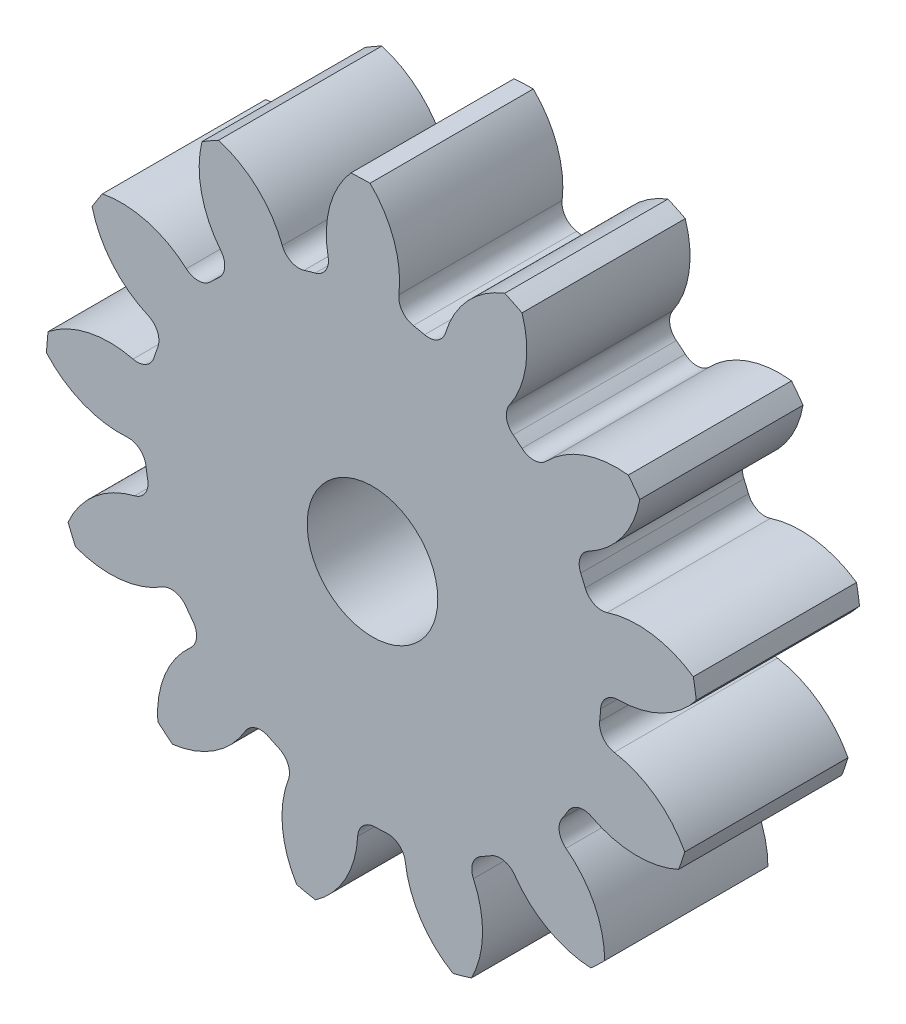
ISO-10303-21;
HEADER;
FILE_DESCRIPTION(('STEP AP214'),'2;1');
FILE_NAME('part.step','',(''),(''),'','','');
FILE_SCHEMA(('AUTOMOTIVE_DESIGN { 1 0 10303 214 1 1 1 1 }'));
ENDSEC;
DATA;
#1=APPLICATION_CONTEXT('core data for automotive mechanical design processes');
#2=APPLICATION_PROTOCOL_DEFINITION('international standard','automotive_design',2000,#1);
#3=PRODUCT_CONTEXT('',#1,'mechanical');
#4=PRODUCT('Part','Part','',(#3));
#5=PRODUCT_RELATED_PRODUCT_CATEGORY('part','',(#4));
#6=PRODUCT_DEFINITION_FORMATION('','',#4);
#7=PRODUCT_DEFINITION_CONTEXT('part definition',#1,'design');
#8=PRODUCT_DEFINITION('design','',#6,#7);
#9=PRODUCT_DEFINITION_SHAPE('','',#8);
#10=(LENGTH_UNIT() NAMED_UNIT(*) SI_UNIT(.MILLI.,.METRE.));
#11=(NAMED_UNIT(*) PLANE_ANGLE_UNIT() SI_UNIT($,.RADIAN.));
#12=(NAMED_UNIT(*) SI_UNIT($,.STERADIAN.) SOLID_ANGLE_UNIT());
#13=UNCERTAINTY_MEASURE_WITH_UNIT(LENGTH_MEASURE(1.E-05),#10,'distance_accuracy_value','');
#14=(GEOMETRIC_REPRESENTATION_CONTEXT(3) GLOBAL_UNCERTAINTY_ASSIGNED_CONTEXT((#13)) GLOBAL_UNIT_ASSIGNED_CONTEXT((#10,
#11,#12)) REPRESENTATION_CONTEXT('',''));
#15=CARTESIAN_POINT('',(0.,0.,0.));
#16=DIRECTION('',(0.,0.,1.));
#17=DIRECTION('',(1.,0.,0.));
#18=AXIS2_PLACEMENT_3D('',#15,#16,#17);
#19=CARTESIAN_POINT('',(0.,0.,127.));
#20=DIRECTION('',(0.,0.,-1.));
#21=DIRECTION('',(-1.,0.,0.));
#22=AXIS2_PLACEMENT_3D('',#19,#20,#21);
#23=CYLINDRICAL_SURFACE('',#22,254.);
#24=DIRECTION('',(0.,0.,-1.));
#25=VECTOR('',#24,1.);
#26=CARTESIAN_POINT('',(249.56865754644,47.2385983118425,63.5));
#27=LINE('',#26,#25);
#28=CARTESIAN_POINT('',(249.56865754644,47.2385983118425,127.));
#29=VERTEX_POINT('',#28);
#30=CARTESIAN_POINT('',(249.56865754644,47.2385983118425,0.));
#31=VERTEX_POINT('',#30);
#32=EDGE_CURVE('E564',#29,#31,#27,.T.);
#33=ORIENTED_EDGE('',*,*,#32,.F.);
#34=CARTESIAN_POINT('',(0.,0.,127.));
#35=DIRECTION('',(0.,0.,1.));
#36=DIRECTION('',(1.,0.,0.));
#37=AXIS2_PLACEMENT_3D('',#34,#35,#36);
#38=CIRCLE('',#37,254.);
#39=CARTESIAN_POINT('',(251.913767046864,32.4877511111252,127.));
#40=VERTEX_POINT('',#39);
#41=EDGE_CURVE('E1019',#40,#29,#38,.T.);
#42=ORIENTED_EDGE('',*,*,#41,.F.);
#43=DIRECTION('',(0.,0.,-1.));
#44=VECTOR('',#43,1.);
#45=CARTESIAN_POINT('',(251.913767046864,32.4877511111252,63.5));
#46=LINE('',#45,#44);
#47=CARTESIAN_POINT('',(251.913767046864,32.4877511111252,0.));
#48=VERTEX_POINT('',#47);
#49=EDGE_CURVE('E1013',#48,#40,#46,.F.);
#50=ORIENTED_EDGE('',*,*,#49,.F.);
#51=CARTESIAN_POINT('',(0.,0.,0.));
#52=DIRECTION('',(0.,0.,1.));
#53=DIRECTION('',(1.,0.,0.));
#54=AXIS2_PLACEMENT_3D('',#51,#52,#53);
#55=CIRCLE('',#54,254.);
#56=EDGE_CURVE('E1024',#48,#31,#55,.T.);
#57=ORIENTED_EDGE('',*,*,#56,.T.);
#58=EDGE_LOOP('',(#33,#42,#50,#57));
#59=FACE_BOUND('',#58,.T.);
#60=ADVANCED_FACE('F33',(#59),#23,.T.);
#61=DIRECTION('',(0.,0.,-1.));
#62=VECTOR('',#61,1.);
#63=CARTESIAN_POINT('',(207.960752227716,145.836639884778,63.5));
#64=LINE('',#63,#62);
#65=CARTESIAN_POINT('',(207.960752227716,145.836639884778,0.));
#66=VERTEX_POINT('',#65);
#67=CARTESIAN_POINT('',(207.960752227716,145.836639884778,127.));
#68=VERTEX_POINT('',#67);
#69=EDGE_CURVE('E535',#66,#68,#64,.F.);
#70=ORIENTED_EDGE('',*,*,#69,.F.);
#71=CARTESIAN_POINT('',(199.029200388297,157.808039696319,0.));
#72=VERTEX_POINT('',#71);
#73=EDGE_CURVE('E1027',#66,#72,#55,.T.);
#74=ORIENTED_EDGE('',*,*,#73,.T.);
#75=DIRECTION('',(0.,0.,-1.));
#76=VECTOR('',#75,1.);
#77=CARTESIAN_POINT('',(199.029200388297,157.808039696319,63.5));
#78=LINE('',#77,#76);
#79=CARTESIAN_POINT('',(199.029200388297,157.808039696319,127.));
#80=VERTEX_POINT('',#79);
#81=EDGE_CURVE('E597',#80,#72,#78,.T.);
#82=ORIENTED_EDGE('',*,*,#81,.F.);
#83=EDGE_CURVE('E1022',#68,#80,#38,.T.);
#84=ORIENTED_EDGE('',*,*,#83,.F.);
#85=EDGE_LOOP('',(#70,#74,#82,#84));
#86=FACE_BOUND('',#85,.T.);
#87=ADVANCED_FACE('F1176',(#86),#23,.T.);
#88=CARTESIAN_POINT('',(0.,0.,127.));
#89=DIRECTION('',(0.,0.,1.));
#90=DIRECTION('',(1.,0.,0.));
#91=AXIS2_PLACEMENT_3D('',#88,#89,#90);
#92=PLANE('',#91);
#93=CARTESIAN_POINT('',(0.,0.,127.000000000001));
#94=DIRECTION('',(0.,0.,1.));
#95=DIRECTION('',(1.,0.,0.));
#96=AXIS2_PLACEMENT_3D('',#93,#94,#95);
#97=CIRCLE('',#96,50.8);
#98=CARTESIAN_POINT('',(50.8,0.,127.000000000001));
#99=VERTEX_POINT('',#98);
#100=EDGE_CURVE('E552',#99,#99,#97,.T.);
#101=ORIENTED_EDGE('',*,*,#100,.F.);
#102=EDGE_LOOP('',(#101));
#103=FACE_BOUND('',#102,.T.);
#104=ORIENTED_EDGE('',*,*,#41,.T.);
#105=CARTESIAN_POINT('',(206.238755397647,-15.9897143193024,127.));
#106=DIRECTION('',(0.,0.,-1.));
#107=DIRECTION('',(0.885456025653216,0.464723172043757,0.));
#108=AXIS2_PLACEMENT_3D('',#105,#106,#107);
#109=CIRCLE('',#108,76.6505051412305);
#110=CARTESIAN_POINT('',(182.580584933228,56.9183847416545,127.));
#111=VERTEX_POINT('',#110);
#112=EDGE_CURVE('E544',#111,#29,#109,.T.);
#113=ORIENTED_EDGE('',*,*,#112,.F.);
#114=CARTESIAN_POINT('',(178.326237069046,70.0291371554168,127.));
#115=DIRECTION('',(0.,0.,1.));
#116=DIRECTION('',(-0.885456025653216,-0.464723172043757,0.));
#117=AXIS2_PLACEMENT_3D('',#114,#115,#116);
#118=CIRCLE('',#117,13.7837333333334);
#119=CARTESIAN_POINT('',(165.496331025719,64.9908025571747,127.));
#120=VERTEX_POINT('',#119);
#121=EDGE_CURVE('E542',#120,#111,#118,.T.);
#122=ORIENTED_EDGE('',*,*,#121,.F.);
#123=CARTESIAN_POINT('',(0.,0.,127.));
#124=DIRECTION('',(0.,0.,-1.));
#125=DIRECTION('',(0.885456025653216,0.464723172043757,0.));
#126=AXIS2_PLACEMENT_3D('',#123,#124,#125);
#127=CIRCLE('',#126,177.8);
#128=CARTESIAN_POINT('',(162.023264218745,73.2209113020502,127.));
#129=VERTEX_POINT('',#128);
#130=EDGE_CURVE('E527',#129,#120,#127,.T.);
#131=ORIENTED_EDGE('',*,*,#130,.F.);
#132=CARTESIAN_POINT('',(174.583924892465,78.89727528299,127.));
#133=DIRECTION('',(0.,0.,1.));
#134=DIRECTION('',(-0.885456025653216,-0.464723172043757,0.));
#135=AXIS2_PLACEMENT_3D('',#132,#133,#134);
#136=CIRCLE('',#135,13.7837333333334);
#137=CARTESIAN_POINT('',(168.159389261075,91.0922187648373,127.));
#138=VERTEX_POINT('',#137);
#139=EDGE_CURVE('E519',#138,#129,#136,.T.);
#140=ORIENTED_EDGE('',*,*,#139,.F.);
#141=CARTESIAN_POINT('',(132.432936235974,158.907559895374,127.));
#142=DIRECTION('',(0.,0.,-1.));
#143=DIRECTION('',(-0.885456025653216,-0.464723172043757,0.));
#144=AXIS2_PLACEMENT_3D('',#141,#142,#143);
#145=CIRCLE('',#144,76.6505051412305);
#146=EDGE_CURVE('E549',#68,#138,#145,.T.);
#147=ORIENTED_EDGE('',*,*,#146,.F.);
#148=ORIENTED_EDGE('',*,*,#83,.T.);
#149=CARTESIAN_POINT('',(190.046139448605,81.6857397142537,127.));
#150=DIRECTION('',(0.,0.,-1.));
#151=DIRECTION('',(0.568064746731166,0.822983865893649,0.));
#152=AXIS2_PLACEMENT_3D('',#149,#150,#151);
#153=CIRCLE('',#152,76.6505051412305);
#154=CARTESIAN_POINT('',(135.215786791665,135.248155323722,127.));
#155=VERTEX_POINT('',#154);
#156=EDGE_CURVE('E573',#155,#80,#153,.T.);
#157=ORIENTED_EDGE('',*,*,#156,.F.);
#158=CARTESIAN_POINT('',(125.355878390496,144.880056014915,127.));
#159=DIRECTION('',(0.,0.,1.));
#160=DIRECTION('',(-0.568064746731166,-0.822983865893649,0.));
#161=AXIS2_PLACEMENT_3D('',#158,#159,#160);
#162=CIRCLE('',#161,13.7837333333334);
#163=CARTESIAN_POINT('',(116.33699161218,134.456477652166,127.));
#164=VERTEX_POINT('',#163);
#165=EDGE_CURVE('E571',#164,#155,#162,.T.);
#166=ORIENTED_EDGE('',*,*,#165,.F.);
#167=CARTESIAN_POINT('',(0.,0.,127.));
#168=DIRECTION('',(0.,0.,-1.));
#169=DIRECTION('',(0.568064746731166,0.822983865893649,0.));
#170=AXIS2_PLACEMENT_3D('',#167,#168,#169);
#171=CIRCLE('',#170,177.8);
#172=CARTESIAN_POINT('',(109.437021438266,140.12986240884,127.));
#173=VERTEX_POINT('',#172);
#174=EDGE_CURVE('E568',#173,#164,#171,.T.);
#175=ORIENTED_EDGE('',*,*,#174,.F.);
#176=CARTESIAN_POINT('',(117.920996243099,150.993263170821,127.));
#177=DIRECTION('',(0.,0.,1.));
#178=DIRECTION('',(-0.568064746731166,-0.822983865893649,0.));
#179=AXIS2_PLACEMENT_3D('',#176,#177,#178);
#180=CIRCLE('',#179,13.7837333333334);
#181=CARTESIAN_POINT('',(106.565079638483,158.805718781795,127.));
#182=VERTEX_POINT('',#181);
#183=EDGE_CURVE('E566',#182,#173,#180,.T.);
#184=ORIENTED_EDGE('',*,*,#183,.F.);
#185=CARTESIAN_POINT('',(43.4155160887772,202.250310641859,127.));
#186=DIRECTION('',(0.,0.,-1.));
#187=DIRECTION('',(-0.568064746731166,-0.822983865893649,0.));
#188=AXIS2_PLACEMENT_3D('',#185,#186,#187);
#189=CIRCLE('',#188,76.6505051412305);
#190=CARTESIAN_POINT('',(116.366435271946,225.776111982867,127.));
#191=VERTEX_POINT('',#190);
#192=EDGE_CURVE('E576',#191,#182,#189,.T.);
#193=ORIENTED_EDGE('',*,*,#192,.F.);
#194=CARTESIAN_POINT('',(102.894551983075,232.225560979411,127.));
#195=VERTEX_POINT('',#194);
#196=EDGE_CURVE('E1061',#191,#195,#38,.T.);
#197=ORIENTED_EDGE('',*,*,#196,.T.);
#198=CARTESIAN_POINT('',(130.316243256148,160.647975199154,127.));
#199=DIRECTION('',(0.,0.,-1.));
#200=DIRECTION('',(0.120536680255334,0.992708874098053,0.));
#201=AXIS2_PLACEMENT_3D('',#198,#199,#200);
#202=CIRCLE('',#201,76.6505051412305);
#203=CARTESIAN_POINT('',(56.874681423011,182.594203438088,127.));
#204=VERTEX_POINT('',#203);
#205=EDGE_CURVE('E608',#204,#195,#202,.T.);
#206=ORIENTED_EDGE('',*,*,#205,.F.);
#207=CARTESIAN_POINT('',(43.6679986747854,186.540700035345,127.));
#208=DIRECTION('',(0.,0.,1.));
#209=DIRECTION('',(-0.120536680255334,-0.992708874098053,0.));
#210=AXIS2_PLACEMENT_3D('',#207,#208,#209);
#211=CIRCLE('',#210,13.7837333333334);
#212=CARTESIAN_POINT('',(40.5262494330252,173.119794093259,127.));
#213=VERTEX_POINT('',#212);
#214=EDGE_CURVE('E606',#213,#204,#211,.T.);
#215=ORIENTED_EDGE('',*,*,#214,.F.);
#216=CARTESIAN_POINT('',(0.,0.,127.));
#217=DIRECTION('',(0.,0.,-1.));
#218=DIRECTION('',(0.120536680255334,0.992708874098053,0.));
#219=AXIS2_PLACEMENT_3D('',#216,#217,#218);
#220=CIRCLE('',#219,177.8);
#221=CARTESIAN_POINT('',(31.7800759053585,174.936750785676,127.));
#222=VERTEX_POINT('',#221);
#223=EDGE_CURVE('E603',#222,#213,#220,.T.);
#224=ORIENTED_EDGE('',*,*,#223,.F.);
#225=CARTESIAN_POINT('',(34.2437884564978,188.498514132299,127.));
#226=DIRECTION('',(0.,0.,1.));
#227=DIRECTION('',(-0.120536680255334,-0.992708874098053,0.));
#228=AXIS2_PLACEMENT_3D('',#225,#226,#227);
#229=CIRCLE('',#228,13.7837333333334);
#230=CARTESIAN_POINT('',(20.5579945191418,190.138742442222,127.));
#231=VERTEX_POINT('',#230);
#232=EDGE_CURVE('E601',#231,#222,#229,.T.);
#233=ORIENTED_EDGE('',*,*,#232,.F.);
#234=CARTESIAN_POINT('',(-55.5478755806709,199.259952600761,127.));
#235=DIRECTION('',(0.,0.,-1.));
#236=DIRECTION('',(-0.120536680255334,-0.992708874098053,0.));
#237=AXIS2_PLACEMENT_3D('',#234,#235,#236);
#238=CIRCLE('',#237,76.6505051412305);
#239=CARTESIAN_POINT('',(-1.88602963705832,253.992997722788,127.));
#240=VERTEX_POINT('',#239);
#241=EDGE_CURVE('E611',#240,#231,#238,.T.);
#242=ORIENTED_EDGE('',*,*,#241,.F.);
#243=CARTESIAN_POINT('',(-16.8119982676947,253.443004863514,127.));
#244=VERTEX_POINT('',#243);
#245=EDGE_CURVE('E1158',#240,#244,#38,.T.);
#246=ORIENTED_EDGE('',*,*,#245,.T.);
#247=CARTESIAN_POINT('',(40.7324662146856,202.807695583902,127.));
#248=DIRECTION('',(0.,0.,-1.));
#249=DIRECTION('',(-0.354604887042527,0.935016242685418,0.));
#250=AXIS2_PLACEMENT_3D('',#247,#248,#249);
#251=CIRCLE('',#250,76.6505051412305);
#252=CARTESIAN_POINT('',(-34.4957280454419,188.110120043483,127.));
#253=VERTEX_POINT('',#252);
#254=EDGE_CURVE('E646',#253,#244,#251,.T.);
#255=ORIENTED_EDGE('',*,*,#254,.F.);
#256=CARTESIAN_POINT('',(-48.0236932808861,185.467117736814,127.));
#257=DIRECTION('',(0.,0.,1.));
#258=DIRECTION('',(0.354604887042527,-0.935016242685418,0.));
#259=AXIS2_PLACEMENT_3D('',#256,#257,#258);
#260=CIRCLE('',#259,13.7837333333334);
#261=CARTESIAN_POINT('',(-44.5685680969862,172.123452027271,127.));
#262=VERTEX_POINT('',#261);
#263=EDGE_CURVE('E644',#262,#253,#260,.T.);
#264=ORIENTED_EDGE('',*,*,#263,.F.);
#265=CARTESIAN_POINT('',(0.,0.,127.));
#266=DIRECTION('',(0.,0.,-1.));
#267=DIRECTION('',(-0.354604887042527,0.935016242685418,0.));
#268=AXIS2_PLACEMENT_3D('',#265,#266,#267);
#269=CIRCLE('',#268,177.8);
#270=CARTESIAN_POINT('',(-53.1573020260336,169.6677377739,127.));
#271=VERTEX_POINT('',#270);
#272=EDGE_CURVE('E641',#271,#262,#269,.T.);
#273=ORIENTED_EDGE('',*,*,#272,.F.);
#274=CARTESIAN_POINT('',(-57.2782585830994,182.82102715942,127.));
#275=DIRECTION('',(0.,0.,1.));
#276=DIRECTION('',(0.354604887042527,-0.935016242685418,0.));
#277=AXIS2_PLACEMENT_3D('',#274,#275,#276);
#278=CIRCLE('',#277,13.7837333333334);
#279=CARTESIAN_POINT('',(-70.1586793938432,177.913271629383,127.));
#280=VERTEX_POINT('',#279);
#281=EDGE_CURVE('E639',#280,#271,#278,.T.);
#282=ORIENTED_EDGE('',*,*,#281,.F.);
#283=CARTESIAN_POINT('',(-141.785918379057,150.621540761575,127.));
#284=DIRECTION('',(0.,0.,-1.));
#285=DIRECTION('',(0.354604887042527,-0.935016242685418,0.));
#286=AXIS2_PLACEMENT_3D('',#283,#284,#285);
#287=CIRCLE('',#286,76.6505051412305);
#288=CARTESIAN_POINT('',(-119.706427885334,224.023148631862,127.));
#289=VERTEX_POINT('',#288);
#290=EDGE_CURVE('E649',#289,#280,#287,.T.);
#291=ORIENTED_EDGE('',*,*,#290,.F.);
#292=CARTESIAN_POINT('',(-132.667122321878,216.599710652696,127.));
#293=VERTEX_POINT('',#292);
#294=EDGE_CURVE('E1154',#289,#293,#38,.T.);
#295=ORIENTED_EDGE('',*,*,#294,.T.);
#296=CARTESIAN_POINT('',(-58.1826279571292,198.506617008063,127.));
#297=DIRECTION('',(0.,0.,-1.));
#298=DIRECTION('',(-0.748510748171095,0.663122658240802,0.));
#299=AXIS2_PLACEMENT_3D('',#296,#297,#298);
#300=CIRCLE('',#299,76.6505051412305);
#301=CARTESIAN_POINT('',(-117.963581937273,150.532275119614,127.));
#302=VERTEX_POINT('',#301);
#303=EDGE_CURVE('E684',#302,#293,#300,.T.);
#304=ORIENTED_EDGE('',*,*,#303,.F.);
#305=CARTESIAN_POINT('',(-128.713735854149,141.905253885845,127.));
#306=DIRECTION('',(0.,0.,1.));
#307=DIRECTION('',(0.748510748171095,-0.663122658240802,0.));
#308=AXIS2_PLACEMENT_3D('',#305,#306,#307);
#309=CIRCLE('',#308,13.7837333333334);
#310=CARTESIAN_POINT('',(-119.453263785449,131.695701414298,127.));
#311=VERTEX_POINT('',#310);
#312=EDGE_CURVE('E682',#311,#302,#309,.T.);
#313=ORIENTED_EDGE('',*,*,#312,.F.);
#314=CARTESIAN_POINT('',(0.,0.,127.));
#315=DIRECTION('',(0.,0.,-1.));
#316=DIRECTION('',(-0.748510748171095,0.663122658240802,0.));
#317=AXIS2_PLACEMENT_3D('',#314,#315,#316);
#318=CIRCLE('',#317,177.8);
#319=CARTESIAN_POINT('',(-125.916982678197,125.529890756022,127.));
#320=VERTEX_POINT('',#319);
#321=EDGE_CURVE('E679',#320,#311,#318,.T.);
#322=ORIENTED_EDGE('',*,*,#321,.F.);
#323=CARTESIAN_POINT('',(-135.678546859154,135.261446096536,127.));
#324=DIRECTION('',(0.,0.,1.));
#325=DIRECTION('',(0.748510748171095,-0.663122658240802,0.));
#326=AXIS2_PLACEMENT_3D('',#323,#324,#325);
#327=CIRCLE('',#326,13.7837333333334);
#328=CARTESIAN_POINT('',(-144.802845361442,124.930014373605,127.));
#329=VERTEX_POINT('',#328);
#330=EDGE_CURVE('E677',#329,#320,#327,.T.);
#331=ORIENTED_EDGE('',*,*,#330,.F.);
#332=CARTESIAN_POINT('',(-195.542515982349,67.4775491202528,127.));
#333=DIRECTION('',(0.,0.,-1.));
#334=DIRECTION('',(0.748510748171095,-0.663122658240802,0.));
#335=AXIS2_PLACEMENT_3D('',#332,#333,#334);
#336=CIRCLE('',#335,76.6505051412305);
#337=CARTESIAN_POINT('',(-210.103526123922,142.732295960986,127.));
#338=VERTEX_POINT('',#337);
#339=EDGE_CURVE('E687',#338,#329,#336,.T.);
#340=ORIENTED_EDGE('',*,*,#339,.F.);
#341=CARTESIAN_POINT('',(-218.129807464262,130.13603304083,127.));
#342=VERTEX_POINT('',#341);
#343=EDGE_CURVE('E1150',#338,#342,#38,.T.);
#344=ORIENTED_EDGE('',*,*,#343,.T.);
#345=CARTESIAN_POINT('',(-143.768783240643,148.730064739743,127.));
#346=DIRECTION('',(0.,0.,-1.));
#347=DIRECTION('',(-0.97094181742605,0.239315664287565,0.));
#348=AXIS2_PLACEMENT_3D('',#345,#346,#347);
#349=CIRCLE('',#348,76.6505051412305);
#350=CARTESIAN_POINT('',(-174.407400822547,78.4693000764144,127.));
#351=VERTEX_POINT('',#350);
#352=EDGE_CURVE('E722',#351,#342,#349,.T.);
#353=ORIENTED_EDGE('',*,*,#352,.F.);
#354=CARTESIAN_POINT('',(-179.917012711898,65.8346065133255,127.));
#355=DIRECTION('',(0.,0.,1.));
#356=DIRECTION('',(0.97094181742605,-0.239315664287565,0.));
#357=AXIS2_PLACEMENT_3D('',#354,#355,#356);
#358=CIRCLE('',#357,13.7837333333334);
#359=CARTESIAN_POINT('',(-166.97265630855,61.0980527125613,127.));
#360=VERTEX_POINT('',#359);
#361=EDGE_CURVE('E720',#360,#351,#358,.T.);
#362=ORIENTED_EDGE('',*,*,#361,.F.);
#363=CARTESIAN_POINT('',(0.,0.,127.));
#364=DIRECTION('',(0.,0.,-1.));
#365=DIRECTION('',(-0.97094181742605,0.239315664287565,0.));
#366=AXIS2_PLACEMENT_3D('',#363,#364,#365);
#367=CIRCLE('',#366,177.8);
#368=CARTESIAN_POINT('',(-169.830600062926,52.6346585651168,127.));
#369=VERTEX_POINT('',#368);
#370=EDGE_CURVE('E717',#369,#360,#367,.T.);
#371=ORIENTED_EDGE('',*,*,#370,.F.);
#372=CARTESIAN_POINT('',(-182.996515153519,56.7150978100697,127.));
#373=DIRECTION('',(0.,0.,1.));
#374=DIRECTION('',(0.97094181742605,-0.239315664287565,0.));
#375=AXIS2_PLACEMENT_3D('',#372,#373,#374);
#376=CIRCLE('',#375,13.7837333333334);
#377=CARTESIAN_POINT('',(-186.274424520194,43.326796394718,127.));
#378=VERTEX_POINT('',#377);
#379=EDGE_CURVE('E715',#378,#369,#376,.T.);
#380=ORIENTED_EDGE('',*,*,#379,.F.);
#381=CARTESIAN_POINT('',(-204.502679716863,-31.1247358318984,127.));
#382=DIRECTION('',(0.,0.,-1.));
#383=DIRECTION('',(0.97094181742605,-0.239315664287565,0.));
#384=AXIS2_PLACEMENT_3D('',#381,#382,#383);
#385=CIRCLE('',#384,76.6505051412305);
#386=CARTESIAN_POINT('',(-252.368438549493,28.7431943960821,127.));
#387=VERTEX_POINT('',#386);
#388=EDGE_CURVE('E725',#387,#378,#385,.T.);
#389=ORIENTED_EDGE('',*,*,#388,.F.);
#390=CARTESIAN_POINT('',(-253.621582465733,13.8597585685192,127.));
#391=VERTEX_POINT('',#390);
#392=EDGE_CURVE('E1146',#387,#391,#38,.T.);
#393=ORIENTED_EDGE('',*,*,#392,.T.);
#394=CARTESIAN_POINT('',(-196.419242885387,64.8812470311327,127.));
#395=DIRECTION('',(0.,0.,-1.));
#396=DIRECTION('',(-0.970941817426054,-0.239315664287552,0.));
#397=AXIS2_PLACEMENT_3D('',#394,#395,#396);
#398=CIRCLE('',#397,76.6505051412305);
#399=CARTESIAN_POINT('',(-190.896586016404,-11.5700459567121,127.));
#400=VERTEX_POINT('',#399);
#401=EDGE_CURVE('E760',#400,#391,#398,.T.);
#402=ORIENTED_EDGE('',*,*,#401,.F.);
#403=CARTESIAN_POINT('',(-189.903470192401,-25.3179558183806,127.));
#404=DIRECTION('',(0.,0.,1.));
#405=DIRECTION('',(0.970941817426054,0.239315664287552,0.));
#406=AXIS2_PLACEMENT_3D('',#403,#404,#405);
#407=CIRCLE('',#406,13.7837333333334);
#408=CARTESIAN_POINT('',(-176.240625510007,-23.4964235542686,127.));
#409=VERTEX_POINT('',#408);
#410=EDGE_CURVE('E758',#409,#400,#407,.T.);
#411=ORIENTED_EDGE('',*,*,#410,.F.);
#412=CARTESIAN_POINT('',(0.,0.,127.));
#413=DIRECTION('',(0.,0.,-1.));
#414=DIRECTION('',(-0.970941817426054,-0.239315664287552,0.));
#415=AXIS2_PLACEMENT_3D('',#412,#413,#414);
#416=CIRCLE('',#415,177.8);
#417=CARTESIAN_POINT('',(-174.83807365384,-32.318539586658,127.));
#418=VERTEX_POINT('',#417);
#419=EDGE_CURVE('E755',#418,#409,#416,.T.);
#420=ORIENTED_EDGE('',*,*,#419,.F.);
#421=CARTESIAN_POINT('',(-188.39218717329,-34.8239958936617,127.));
#422=DIRECTION('',(0.,0.,1.));
#423=DIRECTION('',(0.970941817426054,0.239315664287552,0.));
#424=AXIS2_PLACEMENT_3D('',#421,#422,#423);
#425=CIRCLE('',#424,13.7837333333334);
#426=CARTESIAN_POINT('',(-185.072777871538,-48.2020684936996,127.));
#427=VERTEX_POINT('',#426);
#428=EDGE_CURVE('E753',#427,#418,#425,.T.);
#429=ORIENTED_EDGE('',*,*,#428,.F.);
#430=CARTESIAN_POINT('',(-166.613744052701,-122.596718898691,127.));
#431=DIRECTION('',(0.,0.,-1.));
#432=DIRECTION('',(0.970941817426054,0.239315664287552,0.));
#433=AXIS2_PLACEMENT_3D('',#430,#431,#432);
#434=CIRCLE('',#433,76.6505051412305);
#435=CARTESIAN_POINT('',(-236.818783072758,-91.830626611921,127.));
#436=VERTEX_POINT('',#435);
#437=EDGE_CURVE('E763',#436,#427,#434,.T.);
#438=ORIENTED_EDGE('',*,*,#437,.F.);
#439=CARTESIAN_POINT('',(-231.011709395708,-105.591619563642,127.));
#440=VERTEX_POINT('',#439);
#441=EDGE_CURVE('E1142',#436,#440,#38,.T.);
#442=ORIENTED_EDGE('',*,*,#441,.T.);
#443=CARTESIAN_POINT('',(-204.07242109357,-33.8310824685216,127.));
#444=DIRECTION('',(0.,0.,-1.));
#445=DIRECTION('',(-0.748510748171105,-0.663122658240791,0.));
#446=AXIS2_PLACEMENT_3D('',#443,#444,#445);
#447=CIRCLE('',#446,76.6505051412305);
#448=CARTESIAN_POINT('',(-163.653663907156,-98.9588338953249,127.));
#449=VERTEX_POINT('',#448);
#450=EDGE_CURVE('E798',#449,#440,#447,.T.);
#451=ORIENTED_EDGE('',*,*,#450,.F.);
#452=CARTESIAN_POINT('',(-156.385331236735,-110.670479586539,127.));
#453=DIRECTION('',(0.,0.,1.));
#454=DIRECTION('',(0.748510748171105,0.663122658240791,0.));
#455=AXIS2_PLACEMENT_3D('',#452,#453,#454);
#456=CIRCLE('',#455,13.7837333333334);
#457=CARTESIAN_POINT('',(-145.133991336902,-102.708152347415,127.));
#458=VERTEX_POINT('',#457);
#459=EDGE_CURVE('E796',#458,#449,#456,.T.);
#460=ORIENTED_EDGE('',*,*,#459,.F.);
#461=CARTESIAN_POINT('',(0.,0.,127.));
#462=DIRECTION('',(0.,0.,-1.));
#463=DIRECTION('',(-0.748510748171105,-0.663122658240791,0.));
#464=AXIS2_PLACEMENT_3D('',#461,#462,#463);
#465=CIRCLE('',#464,177.8);
#466=CARTESIAN_POINT('',(-139.792251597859,-109.867949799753,127.));
#467=VERTEX_POINT('',#466);
#468=EDGE_CURVE('E793',#467,#458,#465,.T.);
#469=ORIENTED_EDGE('',*,*,#468,.F.);
#470=CARTESIAN_POINT('',(-150.629479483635,-118.3853318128,127.));
#471=DIRECTION('',(0.,0.,1.));
#472=DIRECTION('',(0.748510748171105,0.663122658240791,0.));
#473=AXIS2_PLACEMENT_3D('',#470,#471,#472);
#474=CIRCLE('',#473,13.7837333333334);
#475=CARTESIAN_POINT('',(-141.473188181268,-128.688420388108,127.));
#476=VERTEX_POINT('',#475);
#477=EDGE_CURVE('E791',#476,#467,#474,.T.);
#478=ORIENTED_EDGE('',*,*,#477,.F.);
#479=CARTESIAN_POINT('',(-90.5556075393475,-185.983271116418,127.));
#480=DIRECTION('',(0.,0.,-1.));
#481=DIRECTION('',(0.748510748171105,0.663122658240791,0.));
#482=AXIS2_PLACEMENT_3D('',#479,#480,#481);
#483=CIRCLE('',#482,76.6505051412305);
#484=CARTESIAN_POINT('',(-167.016798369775,-191.367157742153,127.));
#485=VERTEX_POINT('',#484);
#486=EDGE_CURVE('E801',#485,#476,#483,.T.);
#487=ORIENTED_EDGE('',*,*,#486,.F.);
#488=CARTESIAN_POINT('',(-155.479837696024,-200.853230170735,127.));
#489=VERTEX_POINT('',#488);
#490=EDGE_CURVE('E1138',#485,#489,#38,.T.);
#491=ORIENTED_EDGE('',*,*,#490,.T.);
#492=CARTESIAN_POINT('',(-164.975066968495,-124.793118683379,127.));
#493=DIRECTION('',(0.,0.,-1.));
#494=DIRECTION('',(-0.35460488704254,-0.935016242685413,0.));
#495=AXIS2_PLACEMENT_3D('',#492,#493,#494);
#496=CIRCLE('',#495,76.6505051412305);
#497=CARTESIAN_POINT('',(-98.9196596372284,-163.677345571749,127.));
#498=VERTEX_POINT('',#497);
#499=EDGE_CURVE('E836',#498,#489,#496,.T.);
#500=ORIENTED_EDGE('',*,*,#499,.F.);
#501=CARTESIAN_POINT('',(-87.0411975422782,-170.669730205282,127.));
#502=DIRECTION('',(0.,0.,1.));
#503=DIRECTION('',(0.35460488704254,0.935016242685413,0.));
#504=AXIS2_PLACEMENT_3D('',#501,#502,#503);
#505=CIRCLE('',#504,13.7837333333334);
#506=CARTESIAN_POINT('',(-80.7789088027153,-158.390681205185,127.));
#507=VERTEX_POINT('',#506);
#508=EDGE_CURVE('E834',#507,#498,#505,.T.);
#509=ORIENTED_EDGE('',*,*,#508,.F.);
#510=CARTESIAN_POINT('',(0.,0.,127.));
#511=DIRECTION('',(0.,0.,-1.));
#512=DIRECTION('',(-0.35460488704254,-0.935016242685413,0.));
#513=AXIS2_PLACEMENT_3D('',#510,#511,#512);
#514=CIRCLE('',#513,177.8);
#515=CARTESIAN_POINT('',(-72.7217093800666,-162.247936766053,127.));
#516=VERTEX_POINT('',#515);
#517=EDGE_CURVE('E831',#516,#507,#514,.T.);
#518=ORIENTED_EDGE('',*,*,#517,.F.);
#519=CARTESIAN_POINT('',(-78.3593733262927,-174.826014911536,127.));
#520=DIRECTION('',(0.,0.,1.));
#521=DIRECTION('',(0.35460488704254,0.935016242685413,0.));
#522=AXIS2_PLACEMENT_3D('',#519,#520,#521);
#523=CIRCLE('',#522,13.7837333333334);
#524=CARTESIAN_POINT('',(-65.4637960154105,-179.693806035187,127.));
#525=VERTEX_POINT('',#524);
#526=EDGE_CURVE('E829',#525,#516,#523,.T.);
#527=ORIENTED_EDGE('',*,*,#526,.F.);
#528=CARTESIAN_POINT('',(6.24772734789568,-206.763297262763,127.));
#529=DIRECTION('',(0.,0.,-1.));
#530=DIRECTION('',(0.35460488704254,0.935016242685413,0.));
#531=AXIS2_PLACEMENT_3D('',#528,#529,#530);
#532=CIRCLE('',#531,76.6505051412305);
#533=CARTESIAN_POINT('',(-58.9532779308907,-247.063779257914,127.));
#534=VERTEX_POINT('',#533);
#535=EDGE_CURVE('E839',#534,#525,#532,.T.);
#536=ORIENTED_EDGE('',*,*,#535,.F.);
#537=CARTESIAN_POINT('',(-44.3294089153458,-250.101786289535,127.));
#538=VERTEX_POINT('',#537);
#539=EDGE_CURVE('E1134',#534,#538,#38,.T.);
#540=ORIENTED_EDGE('',*,*,#539,.T.);
#541=CARTESIAN_POINT('',(-88.0839131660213,-187.166555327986,127.));
#542=DIRECTION('',(0.,0.,-1.));
#543=DIRECTION('',(0.12053668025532,-0.992708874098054,0.));
#544=AXIS2_PLACEMENT_3D('',#541,#542,#543);
#545=CIRCLE('',#544,76.6505051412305);
#546=CARTESIAN_POINT('',(-11.524353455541,-190.899349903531,127.));
#547=VERTEX_POINT('',#546);
#548=EDGE_CURVE('E874',#547,#538,#545,.T.);
#549=ORIENTED_EDGE('',*,*,#548,.F.);
#550=CARTESIAN_POINT('',(2.2430255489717,-191.570602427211,127.));
#551=DIRECTION('',(0.,0.,1.));
#552=DIRECTION('',(-0.12053668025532,0.992708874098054,0.));
#553=AXIS2_PLACEMENT_3D('',#550,#551,#552);
#554=CIRCLE('',#553,13.7837333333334);
#555=CARTESIAN_POINT('',(2.08164824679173,-177.78781381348,127.));
#556=VERTEX_POINT('',#555);
#557=EDGE_CURVE('E872',#556,#547,#554,.T.);
#558=ORIENTED_EDGE('',*,*,#557,.F.);
#559=CARTESIAN_POINT('',(0.,0.,127.));
#560=DIRECTION('',(0.,0.,-1.));
#561=DIRECTION('',(0.12053668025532,-0.992708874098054,0.));
#562=AXIS2_PLACEMENT_3D('',#559,#560,#561);
#563=CIRCLE('',#562,177.8);
#564=CARTESIAN_POINT('',(11.0085000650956,-177.458876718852,127.));
#565=VERTEX_POINT('',#564);
#566=EDGE_CURVE('E869',#565,#556,#563,.T.);
#567=ORIENTED_EDGE('',*,*,#566,.F.);
#568=CARTESIAN_POINT('',(11.8619209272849,-191.216164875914,127.));
#569=DIRECTION('',(0.,0.,1.));
#570=DIRECTION('',(-0.12053668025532,0.992708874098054,0.));
#571=AXIS2_PLACEMENT_3D('',#568,#569,#570);
#572=CIRCLE('',#571,13.7837333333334);
#573=CARTESIAN_POINT('',(25.5425628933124,-189.533506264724,127.));
#574=VERTEX_POINT('',#573);
#575=EDGE_CURVE('E867',#574,#565,#572,.T.);
#576=ORIENTED_EDGE('',*,*,#575,.F.);
#577=CARTESIAN_POINT('',(101.619783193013,-180.176343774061,127.));
#578=DIRECTION('',(0.,0.,-1.));
#579=DIRECTION('',(-0.12053668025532,0.992708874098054,0.));
#580=AXIS2_PLACEMENT_3D('',#577,#578,#579);
#581=CIRCLE('',#580,76.6505051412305);
#582=CARTESIAN_POINT('',(62.6157280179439,-246.161066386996,127.));
#583=VERTEX_POINT('',#582);
#584=EDGE_CURVE('E877',#583,#574,#581,.T.);
#585=ORIENTED_EDGE('',*,*,#584,.F.);
#586=CARTESIAN_POINT('',(76.9763532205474,-242.055037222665,127.));
#587=VERTEX_POINT('',#586);
#588=EDGE_CURVE('E1130',#583,#587,#38,.T.);
#589=ORIENTED_EDGE('',*,*,#588,.T.);
#590=CARTESIAN_POINT('',(8.98620361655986,-206.662389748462,127.));
#591=DIRECTION('',(0.,0.,-1.));
#592=DIRECTION('',(0.568064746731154,-0.822983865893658,0.));
#593=AXIS2_PLACEMENT_3D('',#590,#591,#592);
#594=CIRCLE('',#593,76.6505051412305);
#595=CARTESIAN_POINT('',(78.511043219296,-174.388613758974,127.));
#596=VERTEX_POINT('',#595);
#597=EDGE_CURVE('E912',#596,#587,#594,.T.);
#598=ORIENTED_EDGE('',*,*,#597,.F.);
#599=CARTESIAN_POINT('',(91.0133985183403,-168.584958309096,127.));
#600=DIRECTION('',(0.,0.,1.));
#601=DIRECTION('',(-0.568064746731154,0.822983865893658,0.));
#602=AXIS2_PLACEMENT_3D('',#599,#600,#601);
#603=CIRCLE('',#602,13.7837333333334);
#604=CARTESIAN_POINT('',(84.4653247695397,-156.455900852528,127.));
#605=VERTEX_POINT('',#604);
#606=EDGE_CURVE('E910',#605,#596,#603,.T.);
#607=ORIENTED_EDGE('',*,*,#606,.F.);
#608=CARTESIAN_POINT('',(0.,0.,127.));
#609=DIRECTION('',(0.,0.,-1.));
#610=DIRECTION('',(0.568064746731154,-0.822983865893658,0.));
#611=AXIS2_PLACEMENT_3D('',#608,#609,#610);
#612=CIRCLE('',#611,177.8);
#613=CARTESIAN_POINT('',(92.2167948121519,-152.016126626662,127.));
#614=VERTEX_POINT('',#613);
#615=EDGE_CURVE('E907',#614,#605,#612,.T.);
#616=ORIENTED_EDGE('',*,*,#615,.F.);
#617=CARTESIAN_POINT('',(99.3657920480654,-163.800995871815,127.));
#618=DIRECTION('',(0.,0.,1.));
#619=DIRECTION('',(-0.568064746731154,0.822983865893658,0.));
#620=AXIS2_PLACEMENT_3D('',#617,#618,#619);
#621=CIRCLE('',#620,13.7837333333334);
#622=CARTESIAN_POINT('',(110.69742846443,-155.953364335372,127.));
#623=VERTEX_POINT('',#622);
#624=EDGE_CURVE('E905',#623,#614,#621,.T.);
#625=ORIENTED_EDGE('',*,*,#624,.F.);
#626=CARTESIAN_POINT('',(173.711971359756,-112.313161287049,127.));
#627=DIRECTION('',(0.,0.,-1.));
#628=DIRECTION('',(-0.568064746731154,0.822983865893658,0.));
#629=AXIS2_PLACEMENT_3D('',#626,#627,#628);
#630=CIRCLE('',#629,76.6505051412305);
#631=CARTESIAN_POINT('',(169.840225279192,-188.865819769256,127.));
#632=VERTEX_POINT('',#631);
#633=EDGE_CURVE('E915',#632,#623,#630,.T.);
#634=ORIENTED_EDGE('',*,*,#633,.F.);
#635=CARTESIAN_POINT('',(180.647760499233,-178.556396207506,127.));
#636=VERTEX_POINT('',#635);
#637=EDGE_CURVE('E1129',#632,#636,#38,.T.);
#638=ORIENTED_EDGE('',*,*,#637,.T.);
#639=CARTESIAN_POINT('',(103.99768944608,-178.814361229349,127.));
#640=DIRECTION('',(0.,0.,-1.));
#641=DIRECTION('',(0.885456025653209,-0.46472317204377,0.));
#642=AXIS2_PLACEMENT_3D('',#639,#640,#641);
#643=CIRCLE('',#642,76.6505051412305);
#644=CARTESIAN_POINT('',(150.560506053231,-117.927547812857,127.));
#645=VERTEX_POINT('',#644);
#646=EDGE_CURVE('E950',#645,#636,#643,.T.);
#647=ORIENTED_EDGE('',*,*,#646,.F.);
#648=CARTESIAN_POINT('',(158.933698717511,-106.978531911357,127.));
#649=DIRECTION('',(0.,0.,1.));
#650=DIRECTION('',(-0.885456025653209,0.46472317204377,0.));
#651=AXIS2_PLACEMENT_3D('',#648,#649,#650);
#652=CIRCLE('',#651,13.7837333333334);
#653=CARTESIAN_POINT('',(147.499013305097,-99.2818265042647,127.));
#654=VERTEX_POINT('',#653);
#655=EDGE_CURVE('E948',#654,#645,#652,.T.);
#656=ORIENTED_EDGE('',*,*,#655,.F.);
#657=CARTESIAN_POINT('',(0.,0.,127.));
#658=DIRECTION('',(0.,0.,-1.));
#659=DIRECTION('',(0.885456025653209,-0.46472317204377,0.));
#660=AXIS2_PLACEMENT_3D('',#657,#658,#659);
#661=CIRCLE('',#660,177.8);
#662=CARTESIAN_POINT('',(152.299333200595,-91.7483139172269,127.));
#663=VERTEX_POINT('',#662);
#664=EDGE_CURVE('E945',#663,#654,#661,.T.);
#665=ORIENTED_EDGE('',*,*,#664,.F.);
#666=CARTESIAN_POINT('',(164.106157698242,-98.8609927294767,127.));
#667=DIRECTION('',(0.,0.,1.));
#668=DIRECTION('',(-0.885456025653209,0.46472317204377,0.));
#669=AXIS2_PLACEMENT_3D('',#666,#667,#668);
#670=CIRCLE('',#669,13.7837333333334);
#671=CARTESIAN_POINT('',(170.492847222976,-86.6461860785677,127.));
#672=VERTEX_POINT('',#671);
#673=EDGE_CURVE('E943',#672,#663,#670,.T.);
#674=ORIENTED_EDGE('',*,*,#673,.F.);
#675=CARTESIAN_POINT('',(206.008840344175,-18.7203870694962,127.));
#676=DIRECTION('',(0.,0.,-1.));
#677=DIRECTION('',(-0.885456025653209,0.46472317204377,0.));
#678=AXIS2_PLACEMENT_3D('',#675,#676,#677);
#679=CIRCLE('',#678,76.6505051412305);
#680=CARTESIAN_POINT('',(238.156373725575,-88.3036899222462,127.));
#681=VERTEX_POINT('',#680);
#682=EDGE_CURVE('E953',#681,#672,#679,.T.);
#683=ORIENTED_EDGE('',*,*,#682,.F.);
#684=CARTESIAN_POINT('',(242.93494288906,-74.1526366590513,127.));
#685=VERTEX_POINT('',#684);
#686=EDGE_CURVE('E1023',#681,#685,#38,.T.);
#687=ORIENTED_EDGE('',*,*,#686,.T.);
#688=CARTESIAN_POINT('',(175.184557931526,-110.002117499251,127.));
#689=DIRECTION('',(0.,0.,-1.));
#690=DIRECTION('',(1.,0.,0.));
#691=AXIS2_PLACEMENT_3D('',#688,#689,#690);
#692=CIRCLE('',#691,76.6505051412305);
#693=CARTESIAN_POINT('',(188.118371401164,-34.4507018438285,127.));
#694=VERTEX_POINT('',#693);
#695=EDGE_CURVE('E988',#694,#685,#692,.T.);
#696=ORIENTED_EDGE('',*,*,#695,.F.);
#697=CARTESIAN_POINT('',(190.444203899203,-20.8646130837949,127.));
#698=DIRECTION('',(0.,0.,1.));
#699=DIRECTION('',(-1.,0.,0.));
#700=AXIS2_PLACEMENT_3D('',#697,#698,#699);
#701=CIRCLE('',#700,13.7837333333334);
#702=CARTESIAN_POINT('',(176.742455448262,-19.363482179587,127.));
#703=VERTEX_POINT('',#702);
#704=EDGE_CURVE('E986',#703,#694,#701,.T.);
#705=ORIENTED_EDGE('',*,*,#704,.F.);
#706=CARTESIAN_POINT('',(0.,0.,127.));
#707=DIRECTION('',(0.,0.,-1.));
#708=DIRECTION('',(1.,0.,0.));
#709=AXIS2_PLACEMENT_3D('',#706,#707,#708);
#710=CIRCLE('',#709,177.8);
#711=CARTESIAN_POINT('',(177.491929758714,-10.4620681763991,127.));
#712=VERTEX_POINT('',#711);
#713=EDGE_CURVE('E983',#712,#703,#710,.T.);
#714=ORIENTED_EDGE('',*,*,#713,.F.);
#715=CARTESIAN_POINT('',(191.251780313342,-11.2731275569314,127.));
#716=DIRECTION('',(0.,0.,1.));
#717=DIRECTION('',(-1.,0.,0.));
#718=AXIS2_PLACEMENT_3D('',#715,#716,#717);
#719=CIRCLE('',#718,13.7837333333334);
#720=CARTESIAN_POINT('',(191.230409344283,2.51058920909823,127.));
#721=VERTEX_POINT('',#720);
#722=EDGE_CURVE('E981',#721,#712,#719,.T.);
#723=ORIENTED_EDGE('',*,*,#722,.F.);
#724=CARTESIAN_POINT('',(191.111566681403,79.1610022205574,127.));
#725=DIRECTION('',(0.,0.,-1.));
#726=DIRECTION('',(-1.,0.,0.));
#727=AXIS2_PLACEMENT_3D('',#724,#725,#726);
#728=CIRCLE('',#727,76.6505051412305);
#729=EDGE_CURVE('E991',#40,#721,#728,.T.);
#730=ORIENTED_EDGE('',*,*,#729,.F.);
#731=EDGE_LOOP('',(#104,#113,#122,#131,#140,#147,#148,#157,#166,#175,#184,#193,#197,#206,#215,
#224,#233,#242,#246,#255,#264,#273,#282,#291,#295,#304,#313,#322,#331,#340,#344,#353,#362,#371,
#380,#389,#393,#402,#411,#420,#429,#438,#442,#451,#460,#469,#478,#487,#491,#500,#509,#518,#527,
#536,#540,#549,#558,#567,#576,#585,#589,#598,#607,#616,#625,#634,#638,#647,#656,#665,#674,#683,
#687,#696,#705,#714,#723,#730));
#732=FACE_BOUND('',#731,.T.);
#733=ADVANCED_FACE('F540',(#103,#732),#92,.T.);
#734=CARTESIAN_POINT('',(0.,0.,0.));
#735=DIRECTION('',(0.,0.,1.));
#736=DIRECTION('',(1.,0.,0.));
#737=AXIS2_PLACEMENT_3D('',#734,#735,#736);
#738=PLANE('',#737);
#739=CARTESIAN_POINT('',(0.,0.,0.));
#740=DIRECTION('',(0.,0.,1.));
#741=DIRECTION('',(1.,0.,0.));
#742=AXIS2_PLACEMENT_3D('',#739,#740,#741);
#743=CIRCLE('',#742,50.8);
#744=CARTESIAN_POINT('',(50.8,0.,-1.77635683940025E-12));
#745=VERTEX_POINT('',#744);
#746=EDGE_CURVE('E36',#745,#745,#743,.T.);
#747=ORIENTED_EDGE('',*,*,#746,.T.);
#748=EDGE_LOOP('',(#747));
#749=FACE_BOUND('',#748,.T.);
#750=CARTESIAN_POINT('',(206.238755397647,-15.9897143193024,0.));
#751=DIRECTION('',(0.,0.,-1.));
#752=DIRECTION('',(0.885456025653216,0.464723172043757,0.));
#753=AXIS2_PLACEMENT_3D('',#750,#751,#752);
#754=CIRCLE('',#753,76.6505051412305);
#755=CARTESIAN_POINT('',(182.580584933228,56.9183847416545,0.));
#756=VERTEX_POINT('',#755);
#757=EDGE_CURVE('E528',#756,#31,#754,.T.);
#758=ORIENTED_EDGE('',*,*,#757,.T.);
#759=ORIENTED_EDGE('',*,*,#56,.F.);
#760=CARTESIAN_POINT('',(191.111566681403,79.1610022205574,0.));
#761=DIRECTION('',(0.,0.,1.));
#762=DIRECTION('',(1.,0.,0.));
#763=AXIS2_PLACEMENT_3D('',#760,#761,#762);
#764=CIRCLE('',#763,76.6505051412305);
#765=CARTESIAN_POINT('',(191.230409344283,2.51058920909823,0.));
#766=VERTEX_POINT('',#765);
#767=EDGE_CURVE('E1021',#766,#48,#764,.T.);
#768=ORIENTED_EDGE('',*,*,#767,.F.);
#769=CARTESIAN_POINT('',(191.251780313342,-11.2731275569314,0.));
#770=DIRECTION('',(0.,0.,1.));
#771=DIRECTION('',(-1.,0.,0.));
#772=AXIS2_PLACEMENT_3D('',#769,#770,#771);
#773=CIRCLE('',#772,13.7837333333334);
#774=CARTESIAN_POINT('',(177.491929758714,-10.4620681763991,0.));
#775=VERTEX_POINT('',#774);
#776=EDGE_CURVE('E980',#766,#775,#773,.T.);
#777=ORIENTED_EDGE('',*,*,#776,.T.);
#778=CARTESIAN_POINT('',(0.,0.,0.));
#779=DIRECTION('',(0.,0.,-1.));
#780=DIRECTION('',(1.,0.,0.));
#781=AXIS2_PLACEMENT_3D('',#778,#779,#780);
#782=CIRCLE('',#781,177.8);
#783=CARTESIAN_POINT('',(176.742455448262,-19.363482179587,0.));
#784=VERTEX_POINT('',#783);
#785=EDGE_CURVE('E996',#775,#784,#782,.T.);
#786=ORIENTED_EDGE('',*,*,#785,.T.);
#787=CARTESIAN_POINT('',(190.444203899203,-20.8646130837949,0.));
#788=DIRECTION('',(0.,0.,1.));
#789=DIRECTION('',(-1.,0.,0.));
#790=AXIS2_PLACEMENT_3D('',#787,#788,#789);
#791=CIRCLE('',#790,13.7837333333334);
#792=CARTESIAN_POINT('',(188.118371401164,-34.4507018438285,0.));
#793=VERTEX_POINT('',#792);
#794=EDGE_CURVE('E999',#784,#793,#791,.T.);
#795=ORIENTED_EDGE('',*,*,#794,.T.);
#796=CARTESIAN_POINT('',(175.184557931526,-110.002117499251,0.));
#797=DIRECTION('',(0.,0.,-1.));
#798=DIRECTION('',(1.,0.,0.));
#799=AXIS2_PLACEMENT_3D('',#796,#797,#798);
#800=CIRCLE('',#799,76.6505051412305);
#801=CARTESIAN_POINT('',(242.93494288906,-74.1526366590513,0.));
#802=VERTEX_POINT('',#801);
#803=EDGE_CURVE('E984',#793,#802,#800,.T.);
#804=ORIENTED_EDGE('',*,*,#803,.T.);
#805=CARTESIAN_POINT('',(238.156373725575,-88.3036899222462,0.));
#806=VERTEX_POINT('',#805);
#807=EDGE_CURVE('E1018',#806,#802,#55,.T.);
#808=ORIENTED_EDGE('',*,*,#807,.F.);
#809=CARTESIAN_POINT('',(206.008840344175,-18.7203870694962,0.));
#810=DIRECTION('',(0.,0.,1.));
#811=DIRECTION('',(1.,0.,0.));
#812=AXIS2_PLACEMENT_3D('',#809,#810,#811);
#813=CIRCLE('',#812,76.6505051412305);
#814=CARTESIAN_POINT('',(170.492847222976,-86.6461860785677,0.));
#815=VERTEX_POINT('',#814);
#816=EDGE_CURVE('E1029',#815,#806,#813,.T.);
#817=ORIENTED_EDGE('',*,*,#816,.F.);
#818=CARTESIAN_POINT('',(164.106157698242,-98.8609927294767,0.));
#819=DIRECTION('',(0.,0.,1.));
#820=DIRECTION('',(-0.885456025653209,0.46472317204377,0.));
#821=AXIS2_PLACEMENT_3D('',#818,#819,#820);
#822=CIRCLE('',#821,13.7837333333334);
#823=CARTESIAN_POINT('',(152.299333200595,-91.7483139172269,0.));
#824=VERTEX_POINT('',#823);
#825=EDGE_CURVE('E942',#815,#824,#822,.T.);
#826=ORIENTED_EDGE('',*,*,#825,.T.);
#827=CARTESIAN_POINT('',(0.,0.,0.));
#828=DIRECTION('',(0.,0.,-1.));
#829=DIRECTION('',(0.885456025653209,-0.46472317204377,0.));
#830=AXIS2_PLACEMENT_3D('',#827,#828,#829);
#831=CIRCLE('',#830,177.8);
#832=CARTESIAN_POINT('',(147.499013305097,-99.2818265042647,0.));
#833=VERTEX_POINT('',#832);
#834=EDGE_CURVE('E958',#824,#833,#831,.T.);
#835=ORIENTED_EDGE('',*,*,#834,.T.);
#836=CARTESIAN_POINT('',(158.933698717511,-106.978531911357,0.));
#837=DIRECTION('',(0.,0.,1.));
#838=DIRECTION('',(-0.885456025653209,0.46472317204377,0.));
#839=AXIS2_PLACEMENT_3D('',#836,#837,#838);
#840=CIRCLE('',#839,13.7837333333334);
#841=CARTESIAN_POINT('',(150.560506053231,-117.927547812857,0.));
#842=VERTEX_POINT('',#841);
#843=EDGE_CURVE('E961',#833,#842,#840,.T.);
#844=ORIENTED_EDGE('',*,*,#843,.T.);
#845=CARTESIAN_POINT('',(103.99768944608,-178.814361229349,0.));
#846=DIRECTION('',(0.,0.,-1.));
#847=DIRECTION('',(0.885456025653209,-0.46472317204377,0.));
#848=AXIS2_PLACEMENT_3D('',#845,#846,#847);
#849=CIRCLE('',#848,76.6505051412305);
#850=CARTESIAN_POINT('',(180.647760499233,-178.556396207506,0.));
#851=VERTEX_POINT('',#850);
#852=EDGE_CURVE('E946',#842,#851,#849,.T.);
#853=ORIENTED_EDGE('',*,*,#852,.T.);
#854=CARTESIAN_POINT('',(169.840225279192,-188.865819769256,0.));
#855=VERTEX_POINT('',#854);
#856=EDGE_CURVE('E1100',#855,#851,#55,.T.);
#857=ORIENTED_EDGE('',*,*,#856,.F.);
#858=CARTESIAN_POINT('',(173.711971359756,-112.313161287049,0.));
#859=DIRECTION('',(0.,0.,1.));
#860=DIRECTION('',(1.,0.,0.));
#861=AXIS2_PLACEMENT_3D('',#858,#859,#860);
#862=CIRCLE('',#861,76.6505051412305);
#863=CARTESIAN_POINT('',(110.69742846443,-155.953364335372,0.));
#864=VERTEX_POINT('',#863);
#865=EDGE_CURVE('E1031',#864,#855,#862,.T.);
#866=ORIENTED_EDGE('',*,*,#865,.F.);
#867=CARTESIAN_POINT('',(99.3657920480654,-163.800995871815,0.));
#868=DIRECTION('',(0.,0.,1.));
#869=DIRECTION('',(-0.568064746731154,0.822983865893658,0.));
#870=AXIS2_PLACEMENT_3D('',#867,#868,#869);
#871=CIRCLE('',#870,13.7837333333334);
#872=CARTESIAN_POINT('',(92.2167948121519,-152.016126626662,0.));
#873=VERTEX_POINT('',#872);
#874=EDGE_CURVE('E904',#864,#873,#871,.T.);
#875=ORIENTED_EDGE('',*,*,#874,.T.);
#876=CARTESIAN_POINT('',(0.,0.,0.));
#877=DIRECTION('',(0.,0.,-1.));
#878=DIRECTION('',(0.568064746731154,-0.822983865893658,0.));
#879=AXIS2_PLACEMENT_3D('',#876,#877,#878);
#880=CIRCLE('',#879,177.8);
#881=CARTESIAN_POINT('',(84.4653247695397,-156.455900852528,0.));
#882=VERTEX_POINT('',#881);
#883=EDGE_CURVE('E920',#873,#882,#880,.T.);
#884=ORIENTED_EDGE('',*,*,#883,.T.);
#885=CARTESIAN_POINT('',(91.0133985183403,-168.584958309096,0.));
#886=DIRECTION('',(0.,0.,1.));
#887=DIRECTION('',(-0.568064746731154,0.822983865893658,0.));
#888=AXIS2_PLACEMENT_3D('',#885,#886,#887);
#889=CIRCLE('',#888,13.7837333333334);
#890=CARTESIAN_POINT('',(78.511043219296,-174.388613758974,0.));
#891=VERTEX_POINT('',#890);
#892=EDGE_CURVE('E923',#882,#891,#889,.T.);
#893=ORIENTED_EDGE('',*,*,#892,.T.);
#894=CARTESIAN_POINT('',(8.98620361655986,-206.662389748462,0.));
#895=DIRECTION('',(0.,0.,-1.));
#896=DIRECTION('',(0.568064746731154,-0.822983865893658,0.));
#897=AXIS2_PLACEMENT_3D('',#894,#895,#896);
#898=CIRCLE('',#897,76.6505051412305);
#899=CARTESIAN_POINT('',(76.9763532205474,-242.055037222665,0.));
#900=VERTEX_POINT('',#899);
#901=EDGE_CURVE('E908',#891,#900,#898,.T.);
#902=ORIENTED_EDGE('',*,*,#901,.T.);
#903=CARTESIAN_POINT('',(62.6157280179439,-246.161066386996,0.));
#904=VERTEX_POINT('',#903);
#905=EDGE_CURVE('E1095',#904,#900,#55,.T.);
#906=ORIENTED_EDGE('',*,*,#905,.F.);
#907=CARTESIAN_POINT('',(101.619783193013,-180.176343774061,0.));
#908=DIRECTION('',(0.,0.,1.));
#909=DIRECTION('',(1.,0.,0.));
#910=AXIS2_PLACEMENT_3D('',#907,#908,#909);
#911=CIRCLE('',#910,76.6505051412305);
#912=CARTESIAN_POINT('',(25.5425628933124,-189.533506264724,0.));
#913=VERTEX_POINT('',#912);
#914=EDGE_CURVE('E1033',#913,#904,#911,.T.);
#915=ORIENTED_EDGE('',*,*,#914,.F.);
#916=CARTESIAN_POINT('',(11.8619209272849,-191.216164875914,0.));
#917=DIRECTION('',(0.,0.,1.));
#918=DIRECTION('',(-0.12053668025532,0.992708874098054,0.));
#919=AXIS2_PLACEMENT_3D('',#916,#917,#918);
#920=CIRCLE('',#919,13.7837333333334);
#921=CARTESIAN_POINT('',(11.0085000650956,-177.458876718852,0.));
#922=VERTEX_POINT('',#921);
#923=EDGE_CURVE('E866',#913,#922,#920,.T.);
#924=ORIENTED_EDGE('',*,*,#923,.T.);
#925=CARTESIAN_POINT('',(0.,0.,0.));
#926=DIRECTION('',(0.,0.,-1.));
#927=DIRECTION('',(0.12053668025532,-0.992708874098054,0.));
#928=AXIS2_PLACEMENT_3D('',#925,#926,#927);
#929=CIRCLE('',#928,177.8);
#930=CARTESIAN_POINT('',(2.08164824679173,-177.78781381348,0.));
#931=VERTEX_POINT('',#930);
#932=EDGE_CURVE('E882',#922,#931,#929,.T.);
#933=ORIENTED_EDGE('',*,*,#932,.T.);
#934=CARTESIAN_POINT('',(2.2430255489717,-191.570602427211,0.));
#935=DIRECTION('',(0.,0.,1.));
#936=DIRECTION('',(-0.12053668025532,0.992708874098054,0.));
#937=AXIS2_PLACEMENT_3D('',#934,#935,#936);
#938=CIRCLE('',#937,13.7837333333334);
#939=CARTESIAN_POINT('',(-11.524353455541,-190.899349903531,0.));
#940=VERTEX_POINT('',#939);
#941=EDGE_CURVE('E885',#931,#940,#938,.T.);
#942=ORIENTED_EDGE('',*,*,#941,.T.);
#943=CARTESIAN_POINT('',(-88.0839131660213,-187.166555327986,0.));
#944=DIRECTION('',(0.,0.,-1.));
#945=DIRECTION('',(0.12053668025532,-0.992708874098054,0.));
#946=AXIS2_PLACEMENT_3D('',#943,#944,#945);
#947=CIRCLE('',#946,76.6505051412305);
#948=CARTESIAN_POINT('',(-44.3294089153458,-250.101786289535,0.));
#949=VERTEX_POINT('',#948);
#950=EDGE_CURVE('E870',#940,#949,#947,.T.);
#951=ORIENTED_EDGE('',*,*,#950,.T.);
#952=CARTESIAN_POINT('',(-58.9532779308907,-247.063779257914,0.));
#953=VERTEX_POINT('',#952);
#954=EDGE_CURVE('E1090',#953,#949,#55,.T.);
#955=ORIENTED_EDGE('',*,*,#954,.F.);
#956=CARTESIAN_POINT('',(6.24772734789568,-206.763297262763,0.));
#957=DIRECTION('',(0.,0.,1.));
#958=DIRECTION('',(1.,0.,0.));
#959=AXIS2_PLACEMENT_3D('',#956,#957,#958);
#960=CIRCLE('',#959,76.6505051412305);
#961=CARTESIAN_POINT('',(-65.4637960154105,-179.693806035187,0.));
#962=VERTEX_POINT('',#961);
#963=EDGE_CURVE('E1035',#962,#953,#960,.T.);
#964=ORIENTED_EDGE('',*,*,#963,.F.);
#965=CARTESIAN_POINT('',(-78.3593733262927,-174.826014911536,0.));
#966=DIRECTION('',(0.,0.,1.));
#967=DIRECTION('',(0.35460488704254,0.935016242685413,0.));
#968=AXIS2_PLACEMENT_3D('',#965,#966,#967);
#969=CIRCLE('',#968,13.7837333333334);
#970=CARTESIAN_POINT('',(-72.7217093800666,-162.247936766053,0.));
#971=VERTEX_POINT('',#970);
#972=EDGE_CURVE('E828',#962,#971,#969,.T.);
#973=ORIENTED_EDGE('',*,*,#972,.T.);
#974=CARTESIAN_POINT('',(0.,0.,0.));
#975=DIRECTION('',(0.,0.,-1.));
#976=DIRECTION('',(-0.35460488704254,-0.935016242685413,0.));
#977=AXIS2_PLACEMENT_3D('',#974,#975,#976);
#978=CIRCLE('',#977,177.8);
#979=CARTESIAN_POINT('',(-80.7789088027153,-158.390681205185,0.));
#980=VERTEX_POINT('',#979);
#981=EDGE_CURVE('E844',#971,#980,#978,.T.);
#982=ORIENTED_EDGE('',*,*,#981,.T.);
#983=CARTESIAN_POINT('',(-87.0411975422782,-170.669730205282,0.));
#984=DIRECTION('',(0.,0.,1.));
#985=DIRECTION('',(0.35460488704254,0.935016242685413,0.));
#986=AXIS2_PLACEMENT_3D('',#983,#984,#985);
#987=CIRCLE('',#986,13.7837333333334);
#988=CARTESIAN_POINT('',(-98.9196596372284,-163.677345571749,0.));
#989=VERTEX_POINT('',#988);
#990=EDGE_CURVE('E847',#980,#989,#987,.T.);
#991=ORIENTED_EDGE('',*,*,#990,.T.);
#992=CARTESIAN_POINT('',(-164.975066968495,-124.793118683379,0.));
#993=DIRECTION('',(0.,0.,-1.));
#994=DIRECTION('',(-0.35460488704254,-0.935016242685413,0.));
#995=AXIS2_PLACEMENT_3D('',#992,#993,#994);
#996=CIRCLE('',#995,76.6505051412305);
#997=CARTESIAN_POINT('',(-155.479837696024,-200.853230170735,0.));
#998=VERTEX_POINT('',#997);
#999=EDGE_CURVE('E832',#989,#998,#996,.T.);
#1000=ORIENTED_EDGE('',*,*,#999,.T.);
#1001=CARTESIAN_POINT('',(-167.016798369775,-191.367157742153,0.));
#1002=VERTEX_POINT('',#1001);
#1003=EDGE_CURVE('E1085',#1002,#998,#55,.T.);
#1004=ORIENTED_EDGE('',*,*,#1003,.F.);
#1005=CARTESIAN_POINT('',(-90.5556075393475,-185.983271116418,0.));
#1006=DIRECTION('',(0.,0.,1.));
#1007=DIRECTION('',(1.,0.,0.));
#1008=AXIS2_PLACEMENT_3D('',#1005,#1006,#1007);
#1009=CIRCLE('',#1008,76.6505051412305);
#1010=CARTESIAN_POINT('',(-141.473188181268,-128.688420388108,0.));
#1011=VERTEX_POINT('',#1010);
#1012=EDGE_CURVE('E1037',#1011,#1002,#1009,.T.);
#1013=ORIENTED_EDGE('',*,*,#1012,.F.);
#1014=CARTESIAN_POINT('',(-150.629479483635,-118.3853318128,0.));
#1015=DIRECTION('',(0.,0.,1.));
#1016=DIRECTION('',(0.748510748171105,0.663122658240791,0.));
#1017=AXIS2_PLACEMENT_3D('',#1014,#1015,#1016);
#1018=CIRCLE('',#1017,13.7837333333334);
#1019=CARTESIAN_POINT('',(-139.792251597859,-109.867949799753,0.));
#1020=VERTEX_POINT('',#1019);
#1021=EDGE_CURVE('E790',#1011,#1020,#1018,.T.);
#1022=ORIENTED_EDGE('',*,*,#1021,.T.);
#1023=CARTESIAN_POINT('',(0.,0.,0.));
#1024=DIRECTION('',(0.,0.,-1.));
#1025=DIRECTION('',(-0.748510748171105,-0.663122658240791,0.));
#1026=AXIS2_PLACEMENT_3D('',#1023,#1024,#1025);
#1027=CIRCLE('',#1026,177.8);
#1028=CARTESIAN_POINT('',(-145.133991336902,-102.708152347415,0.));
#1029=VERTEX_POINT('',#1028);
#1030=EDGE_CURVE('E806',#1020,#1029,#1027,.T.);
#1031=ORIENTED_EDGE('',*,*,#1030,.T.);
#1032=CARTESIAN_POINT('',(-156.385331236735,-110.670479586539,0.));
#1033=DIRECTION('',(0.,0.,1.));
#1034=DIRECTION('',(0.748510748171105,0.663122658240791,0.));
#1035=AXIS2_PLACEMENT_3D('',#1032,#1033,#1034);
#1036=CIRCLE('',#1035,13.7837333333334);
#1037=CARTESIAN_POINT('',(-163.653663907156,-98.9588338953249,0.));
#1038=VERTEX_POINT('',#1037);
#1039=EDGE_CURVE('E809',#1029,#1038,#1036,.T.);
#1040=ORIENTED_EDGE('',*,*,#1039,.T.);
#1041=CARTESIAN_POINT('',(-204.07242109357,-33.8310824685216,0.));
#1042=DIRECTION('',(0.,0.,-1.));
#1043=DIRECTION('',(-0.748510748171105,-0.663122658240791,0.));
#1044=AXIS2_PLACEMENT_3D('',#1041,#1042,#1043);
#1045=CIRCLE('',#1044,76.6505051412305);
#1046=CARTESIAN_POINT('',(-231.011709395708,-105.591619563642,0.));
#1047=VERTEX_POINT('',#1046);
#1048=EDGE_CURVE('E794',#1038,#1047,#1045,.T.);
#1049=ORIENTED_EDGE('',*,*,#1048,.T.);
#1050=CARTESIAN_POINT('',(-236.818783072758,-91.830626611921,0.));
#1051=VERTEX_POINT('',#1050);
#1052=EDGE_CURVE('E1080',#1051,#1047,#55,.T.);
#1053=ORIENTED_EDGE('',*,*,#1052,.F.);
#1054=CARTESIAN_POINT('',(-166.613744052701,-122.596718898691,0.));
#1055=DIRECTION('',(0.,0.,1.));
#1056=DIRECTION('',(1.,0.,0.));
#1057=AXIS2_PLACEMENT_3D('',#1054,#1055,#1056);
#1058=CIRCLE('',#1057,76.6505051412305);
#1059=CARTESIAN_POINT('',(-185.072777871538,-48.2020684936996,0.));
#1060=VERTEX_POINT('',#1059);
#1061=EDGE_CURVE('E1039',#1060,#1051,#1058,.T.);
#1062=ORIENTED_EDGE('',*,*,#1061,.F.);
#1063=CARTESIAN_POINT('',(-188.39218717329,-34.8239958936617,0.));
#1064=DIRECTION('',(0.,0.,1.));
#1065=DIRECTION('',(0.970941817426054,0.239315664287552,0.));
#1066=AXIS2_PLACEMENT_3D('',#1063,#1064,#1065);
#1067=CIRCLE('',#1066,13.7837333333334);
#1068=CARTESIAN_POINT('',(-174.83807365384,-32.318539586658,0.));
#1069=VERTEX_POINT('',#1068);
#1070=EDGE_CURVE('E752',#1060,#1069,#1067,.T.);
#1071=ORIENTED_EDGE('',*,*,#1070,.T.);
#1072=CARTESIAN_POINT('',(0.,0.,0.));
#1073=DIRECTION('',(0.,0.,-1.));
#1074=DIRECTION('',(-0.970941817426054,-0.239315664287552,0.));
#1075=AXIS2_PLACEMENT_3D('',#1072,#1073,#1074);
#1076=CIRCLE('',#1075,177.8);
#1077=CARTESIAN_POINT('',(-176.240625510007,-23.4964235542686,0.));
#1078=VERTEX_POINT('',#1077);
#1079=EDGE_CURVE('E768',#1069,#1078,#1076,.T.);
#1080=ORIENTED_EDGE('',*,*,#1079,.T.);
#1081=CARTESIAN_POINT('',(-189.903470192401,-25.3179558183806,0.));
#1082=DIRECTION('',(0.,0.,1.));
#1083=DIRECTION('',(0.970941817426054,0.239315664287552,0.));
#1084=AXIS2_PLACEMENT_3D('',#1081,#1082,#1083);
#1085=CIRCLE('',#1084,13.7837333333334);
#1086=CARTESIAN_POINT('',(-190.896586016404,-11.5700459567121,0.));
#1087=VERTEX_POINT('',#1086);
#1088=EDGE_CURVE('E771',#1078,#1087,#1085,.T.);
#1089=ORIENTED_EDGE('',*,*,#1088,.T.);
#1090=CARTESIAN_POINT('',(-196.419242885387,64.8812470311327,0.));
#1091=DIRECTION('',(0.,0.,-1.));
#1092=DIRECTION('',(-0.970941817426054,-0.239315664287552,0.));
#1093=AXIS2_PLACEMENT_3D('',#1090,#1091,#1092);
#1094=CIRCLE('',#1093,76.6505051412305);
#1095=CARTESIAN_POINT('',(-253.621582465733,13.8597585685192,0.));
#1096=VERTEX_POINT('',#1095);
#1097=EDGE_CURVE('E756',#1087,#1096,#1094,.T.);
#1098=ORIENTED_EDGE('',*,*,#1097,.T.);
#1099=CARTESIAN_POINT('',(-252.368438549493,28.7431943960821,0.));
#1100=VERTEX_POINT('',#1099);
#1101=EDGE_CURVE('E1075',#1100,#1096,#55,.T.);
#1102=ORIENTED_EDGE('',*,*,#1101,.F.);
#1103=CARTESIAN_POINT('',(-204.502679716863,-31.1247358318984,0.));
#1104=DIRECTION('',(0.,0.,1.));
#1105=DIRECTION('',(1.,0.,0.));
#1106=AXIS2_PLACEMENT_3D('',#1103,#1104,#1105);
#1107=CIRCLE('',#1106,76.6505051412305);
#1108=CARTESIAN_POINT('',(-186.274424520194,43.326796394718,0.));
#1109=VERTEX_POINT('',#1108);
#1110=EDGE_CURVE('E1041',#1109,#1100,#1107,.T.);
#1111=ORIENTED_EDGE('',*,*,#1110,.F.);
#1112=CARTESIAN_POINT('',(-182.996515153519,56.7150978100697,0.));
#1113=DIRECTION('',(0.,0.,1.));
#1114=DIRECTION('',(0.97094181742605,-0.239315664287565,0.));
#1115=AXIS2_PLACEMENT_3D('',#1112,#1113,#1114);
#1116=CIRCLE('',#1115,13.7837333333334);
#1117=CARTESIAN_POINT('',(-169.830600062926,52.6346585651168,0.));
#1118=VERTEX_POINT('',#1117);
#1119=EDGE_CURVE('E714',#1109,#1118,#1116,.T.);
#1120=ORIENTED_EDGE('',*,*,#1119,.T.);
#1121=CARTESIAN_POINT('',(0.,0.,0.));
#1122=DIRECTION('',(0.,0.,-1.));
#1123=DIRECTION('',(-0.97094181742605,0.239315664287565,0.));
#1124=AXIS2_PLACEMENT_3D('',#1121,#1122,#1123);
#1125=CIRCLE('',#1124,177.8);
#1126=CARTESIAN_POINT('',(-166.97265630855,61.0980527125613,0.));
#1127=VERTEX_POINT('',#1126);
#1128=EDGE_CURVE('E730',#1118,#1127,#1125,.T.);
#1129=ORIENTED_EDGE('',*,*,#1128,.T.);
#1130=CARTESIAN_POINT('',(-179.917012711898,65.8346065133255,0.));
#1131=DIRECTION('',(0.,0.,1.));
#1132=DIRECTION('',(0.97094181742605,-0.239315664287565,0.));
#1133=AXIS2_PLACEMENT_3D('',#1130,#1131,#1132);
#1134=CIRCLE('',#1133,13.7837333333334);
#1135=CARTESIAN_POINT('',(-174.407400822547,78.4693000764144,0.));
#1136=VERTEX_POINT('',#1135);
#1137=EDGE_CURVE('E733',#1127,#1136,#1134,.T.);
#1138=ORIENTED_EDGE('',*,*,#1137,.T.);
#1139=CARTESIAN_POINT('',(-143.768783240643,148.730064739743,0.));
#1140=DIRECTION('',(0.,0.,-1.));
#1141=DIRECTION('',(-0.97094181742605,0.239315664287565,0.));
#1142=AXIS2_PLACEMENT_3D('',#1139,#1140,#1141);
#1143=CIRCLE('',#1142,76.6505051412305);
#1144=CARTESIAN_POINT('',(-218.129807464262,130.13603304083,0.));
#1145=VERTEX_POINT('',#1144);
#1146=EDGE_CURVE('E718',#1136,#1145,#1143,.T.);
#1147=ORIENTED_EDGE('',*,*,#1146,.T.);
#1148=CARTESIAN_POINT('',(-210.103526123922,142.732295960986,0.));
#1149=VERTEX_POINT('',#1148);
#1150=EDGE_CURVE('E1070',#1149,#1145,#55,.T.);
#1151=ORIENTED_EDGE('',*,*,#1150,.F.);
#1152=CARTESIAN_POINT('',(-195.542515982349,67.4775491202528,0.));
#1153=DIRECTION('',(0.,0.,1.));
#1154=DIRECTION('',(1.,0.,0.));
#1155=AXIS2_PLACEMENT_3D('',#1152,#1153,#1154);
#1156=CIRCLE('',#1155,76.6505051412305);
#1157=CARTESIAN_POINT('',(-144.802845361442,124.930014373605,0.));
#1158=VERTEX_POINT('',#1157);
#1159=EDGE_CURVE('E1043',#1158,#1149,#1156,.T.);
#1160=ORIENTED_EDGE('',*,*,#1159,.F.);
#1161=CARTESIAN_POINT('',(-135.678546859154,135.261446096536,0.));
#1162=DIRECTION('',(0.,0.,1.));
#1163=DIRECTION('',(0.748510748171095,-0.663122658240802,0.));
#1164=AXIS2_PLACEMENT_3D('',#1161,#1162,#1163);
#1165=CIRCLE('',#1164,13.7837333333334);
#1166=CARTESIAN_POINT('',(-125.916982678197,125.529890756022,0.));
#1167=VERTEX_POINT('',#1166);
#1168=EDGE_CURVE('E676',#1158,#1167,#1165,.T.);
#1169=ORIENTED_EDGE('',*,*,#1168,.T.);
#1170=CARTESIAN_POINT('',(0.,0.,0.));
#1171=DIRECTION('',(0.,0.,-1.));
#1172=DIRECTION('',(-0.748510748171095,0.663122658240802,0.));
#1173=AXIS2_PLACEMENT_3D('',#1170,#1171,#1172);
#1174=CIRCLE('',#1173,177.8);
#1175=CARTESIAN_POINT('',(-119.453263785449,131.695701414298,0.));
#1176=VERTEX_POINT('',#1175);
#1177=EDGE_CURVE('E692',#1167,#1176,#1174,.T.);
#1178=ORIENTED_EDGE('',*,*,#1177,.T.);
#1179=CARTESIAN_POINT('',(-128.713735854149,141.905253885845,0.));
#1180=DIRECTION('',(0.,0.,1.));
#1181=DIRECTION('',(0.748510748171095,-0.663122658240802,0.));
#1182=AXIS2_PLACEMENT_3D('',#1179,#1180,#1181);
#1183=CIRCLE('',#1182,13.7837333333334);
#1184=CARTESIAN_POINT('',(-117.963581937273,150.532275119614,0.));
#1185=VERTEX_POINT('',#1184);
#1186=EDGE_CURVE('E695',#1176,#1185,#1183,.T.);
#1187=ORIENTED_EDGE('',*,*,#1186,.T.);
#1188=CARTESIAN_POINT('',(-58.1826279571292,198.506617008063,0.));
#1189=DIRECTION('',(0.,0.,-1.));
#1190=DIRECTION('',(-0.748510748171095,0.663122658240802,0.));
#1191=AXIS2_PLACEMENT_3D('',#1188,#1189,#1190);
#1192=CIRCLE('',#1191,76.6505051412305);
#1193=CARTESIAN_POINT('',(-132.667122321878,216.599710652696,0.));
#1194=VERTEX_POINT('',#1193);
#1195=EDGE_CURVE('E680',#1185,#1194,#1192,.T.);
#1196=ORIENTED_EDGE('',*,*,#1195,.T.);
#1197=CARTESIAN_POINT('',(-119.706427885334,224.023148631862,0.));
#1198=VERTEX_POINT('',#1197);
#1199=EDGE_CURVE('E1065',#1198,#1194,#55,.T.);
#1200=ORIENTED_EDGE('',*,*,#1199,.F.);
#1201=CARTESIAN_POINT('',(-141.785918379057,150.621540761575,0.));
#1202=DIRECTION('',(0.,0.,1.));
#1203=DIRECTION('',(1.,0.,0.));
#1204=AXIS2_PLACEMENT_3D('',#1201,#1202,#1203);
#1205=CIRCLE('',#1204,76.6505051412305);
#1206=CARTESIAN_POINT('',(-70.1586793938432,177.913271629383,0.));
#1207=VERTEX_POINT('',#1206);
#1208=EDGE_CURVE('E1045',#1207,#1198,#1205,.T.);
#1209=ORIENTED_EDGE('',*,*,#1208,.F.);
#1210=CARTESIAN_POINT('',(-57.2782585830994,182.82102715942,0.));
#1211=DIRECTION('',(0.,0.,1.));
#1212=DIRECTION('',(0.354604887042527,-0.935016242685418,0.));
#1213=AXIS2_PLACEMENT_3D('',#1210,#1211,#1212);
#1214=CIRCLE('',#1213,13.7837333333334);
#1215=CARTESIAN_POINT('',(-53.1573020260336,169.6677377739,0.));
#1216=VERTEX_POINT('',#1215);
#1217=EDGE_CURVE('E638',#1207,#1216,#1214,.T.);
#1218=ORIENTED_EDGE('',*,*,#1217,.T.);
#1219=CARTESIAN_POINT('',(0.,0.,0.));
#1220=DIRECTION('',(0.,0.,-1.));
#1221=DIRECTION('',(-0.354604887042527,0.935016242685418,0.));
#1222=AXIS2_PLACEMENT_3D('',#1219,#1220,#1221);
#1223=CIRCLE('',#1222,177.8);
#1224=CARTESIAN_POINT('',(-44.5685680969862,172.123452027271,0.));
#1225=VERTEX_POINT('',#1224);
#1226=EDGE_CURVE('E654',#1216,#1225,#1223,.T.);
#1227=ORIENTED_EDGE('',*,*,#1226,.T.);
#1228=CARTESIAN_POINT('',(-48.0236932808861,185.467117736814,0.));
#1229=DIRECTION('',(0.,0.,1.));
#1230=DIRECTION('',(0.354604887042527,-0.935016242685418,0.));
#1231=AXIS2_PLACEMENT_3D('',#1228,#1229,#1230);
#1232=CIRCLE('',#1231,13.7837333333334);
#1233=CARTESIAN_POINT('',(-34.4957280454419,188.110120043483,0.));
#1234=VERTEX_POINT('',#1233);
#1235=EDGE_CURVE('E657',#1225,#1234,#1232,.T.);
#1236=ORIENTED_EDGE('',*,*,#1235,.T.);
#1237=CARTESIAN_POINT('',(40.7324662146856,202.807695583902,0.));
#1238=DIRECTION('',(0.,0.,-1.));
#1239=DIRECTION('',(-0.354604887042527,0.935016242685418,0.));
#1240=AXIS2_PLACEMENT_3D('',#1237,#1238,#1239);
#1241=CIRCLE('',#1240,76.6505051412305);
#1242=CARTESIAN_POINT('',(-16.8119982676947,253.443004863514,0.));
#1243=VERTEX_POINT('',#1242);
#1244=EDGE_CURVE('E642',#1234,#1243,#1241,.T.);
#1245=ORIENTED_EDGE('',*,*,#1244,.T.);
#1246=CARTESIAN_POINT('',(-1.88602963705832,253.992997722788,0.));
#1247=VERTEX_POINT('',#1246);
#1248=EDGE_CURVE('E1064',#1247,#1243,#55,.T.);
#1249=ORIENTED_EDGE('',*,*,#1248,.F.);
#1250=CARTESIAN_POINT('',(-55.5478755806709,199.259952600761,0.));
#1251=DIRECTION('',(0.,0.,1.));
#1252=DIRECTION('',(1.,0.,0.));
#1253=AXIS2_PLACEMENT_3D('',#1250,#1251,#1252);
#1254=CIRCLE('',#1253,76.6505051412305);
#1255=CARTESIAN_POINT('',(20.5579945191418,190.138742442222,0.));
#1256=VERTEX_POINT('',#1255);
#1257=EDGE_CURVE('E1047',#1256,#1247,#1254,.T.);
#1258=ORIENTED_EDGE('',*,*,#1257,.F.);
#1259=CARTESIAN_POINT('',(34.2437884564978,188.498514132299,0.));
#1260=DIRECTION('',(0.,0.,1.));
#1261=DIRECTION('',(-0.120536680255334,-0.992708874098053,0.));
#1262=AXIS2_PLACEMENT_3D('',#1259,#1260,#1261);
#1263=CIRCLE('',#1262,13.7837333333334);
#1264=CARTESIAN_POINT('',(31.7800759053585,174.936750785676,0.));
#1265=VERTEX_POINT('',#1264);
#1266=EDGE_CURVE('E600',#1256,#1265,#1263,.T.);
#1267=ORIENTED_EDGE('',*,*,#1266,.T.);
#1268=CARTESIAN_POINT('',(0.,0.,0.));
#1269=DIRECTION('',(0.,0.,-1.));
#1270=DIRECTION('',(0.120536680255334,0.992708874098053,0.));
#1271=AXIS2_PLACEMENT_3D('',#1268,#1269,#1270);
#1272=CIRCLE('',#1271,177.8);
#1273=CARTESIAN_POINT('',(40.5262494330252,173.119794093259,0.));
#1274=VERTEX_POINT('',#1273);
#1275=EDGE_CURVE('E616',#1265,#1274,#1272,.T.);
#1276=ORIENTED_EDGE('',*,*,#1275,.T.);
#1277=CARTESIAN_POINT('',(43.6679986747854,186.540700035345,0.));
#1278=DIRECTION('',(0.,0.,1.));
#1279=DIRECTION('',(-0.120536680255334,-0.992708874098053,0.));
#1280=AXIS2_PLACEMENT_3D('',#1277,#1278,#1279);
#1281=CIRCLE('',#1280,13.7837333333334);
#1282=CARTESIAN_POINT('',(56.874681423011,182.594203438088,0.));
#1283=VERTEX_POINT('',#1282);
#1284=EDGE_CURVE('E619',#1274,#1283,#1281,.T.);
#1285=ORIENTED_EDGE('',*,*,#1284,.T.);
#1286=CARTESIAN_POINT('',(130.316243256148,160.647975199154,0.));
#1287=DIRECTION('',(0.,0.,-1.));
#1288=DIRECTION('',(0.120536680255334,0.992708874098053,0.));
#1289=AXIS2_PLACEMENT_3D('',#1286,#1287,#1288);
#1290=CIRCLE('',#1289,76.6505051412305);
#1291=CARTESIAN_POINT('',(102.894551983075,232.225560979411,0.));
#1292=VERTEX_POINT('',#1291);
#1293=EDGE_CURVE('E604',#1283,#1292,#1290,.T.);
#1294=ORIENTED_EDGE('',*,*,#1293,.T.);
#1295=CARTESIAN_POINT('',(116.366435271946,225.776111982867,0.));
#1296=VERTEX_POINT('',#1295);
#1297=EDGE_CURVE('E1060',#1296,#1292,#55,.T.);
#1298=ORIENTED_EDGE('',*,*,#1297,.F.);
#1299=CARTESIAN_POINT('',(43.4155160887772,202.250310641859,0.));
#1300=DIRECTION('',(0.,0.,1.));
#1301=DIRECTION('',(1.,0.,0.));
#1302=AXIS2_PLACEMENT_3D('',#1299,#1300,#1301);
#1303=CIRCLE('',#1302,76.6505051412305);
#1304=CARTESIAN_POINT('',(106.565079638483,158.805718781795,0.));
#1305=VERTEX_POINT('',#1304);
#1306=EDGE_CURVE('E41',#1305,#1296,#1303,.T.);
#1307=ORIENTED_EDGE('',*,*,#1306,.F.);
#1308=CARTESIAN_POINT('',(117.920996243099,150.993263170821,0.));
#1309=DIRECTION('',(0.,0.,1.));
#1310=DIRECTION('',(-0.568064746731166,-0.822983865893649,0.));
#1311=AXIS2_PLACEMENT_3D('',#1308,#1309,#1310);
#1312=CIRCLE('',#1311,13.7837333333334);
#1313=CARTESIAN_POINT('',(109.437021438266,140.12986240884,0.));
#1314=VERTEX_POINT('',#1313);
#1315=EDGE_CURVE('E56',#1305,#1314,#1312,.T.);
#1316=ORIENTED_EDGE('',*,*,#1315,.T.);
#1317=CARTESIAN_POINT('',(0.,0.,0.));
#1318=DIRECTION('',(0.,0.,-1.));
#1319=DIRECTION('',(0.568064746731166,0.822983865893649,0.));
#1320=AXIS2_PLACEMENT_3D('',#1317,#1318,#1319);
#1321=CIRCLE('',#1320,177.8);
#1322=CARTESIAN_POINT('',(116.33699161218,134.456477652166,0.));
#1323=VERTEX_POINT('',#1322);
#1324=EDGE_CURVE('E580',#1314,#1323,#1321,.T.);
#1325=ORIENTED_EDGE('',*,*,#1324,.T.);
#1326=CARTESIAN_POINT('',(125.355878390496,144.880056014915,0.));
#1327=DIRECTION('',(0.,0.,1.));
#1328=DIRECTION('',(-0.568064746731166,-0.822983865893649,0.));
#1329=AXIS2_PLACEMENT_3D('',#1326,#1327,#1328);
#1330=CIRCLE('',#1329,13.7837333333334);
#1331=CARTESIAN_POINT('',(135.215786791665,135.248155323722,0.));
#1332=VERTEX_POINT('',#1331);
#1333=EDGE_CURVE('E583',#1323,#1332,#1330,.T.);
#1334=ORIENTED_EDGE('',*,*,#1333,.T.);
#1335=CARTESIAN_POINT('',(190.046139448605,81.6857397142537,0.));
#1336=DIRECTION('',(0.,0.,-1.));
#1337=DIRECTION('',(0.568064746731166,0.822983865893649,0.));
#1338=AXIS2_PLACEMENT_3D('',#1335,#1336,#1337);
#1339=CIRCLE('',#1338,76.6505051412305);
#1340=EDGE_CURVE('E569',#1332,#72,#1339,.T.);
#1341=ORIENTED_EDGE('',*,*,#1340,.T.);
#1342=ORIENTED_EDGE('',*,*,#73,.F.);
#1343=CARTESIAN_POINT('',(132.432936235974,158.907559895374,0.));
#1344=DIRECTION('',(0.,0.,1.));
#1345=DIRECTION('',(1.,0.,0.));
#1346=AXIS2_PLACEMENT_3D('',#1343,#1344,#1345);
#1347=CIRCLE('',#1346,76.6505051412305);
#1348=CARTESIAN_POINT('',(168.159389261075,91.0922187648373,0.));
#1349=VERTEX_POINT('',#1348);
#1350=EDGE_CURVE('E11',#1349,#66,#1347,.T.);
#1351=ORIENTED_EDGE('',*,*,#1350,.F.);
#1352=CARTESIAN_POINT('',(174.583924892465,78.89727528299,0.));
#1353=DIRECTION('',(0.,0.,1.));
#1354=DIRECTION('',(-0.885456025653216,-0.464723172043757,0.));
#1355=AXIS2_PLACEMENT_3D('',#1352,#1353,#1354);
#1356=CIRCLE('',#1355,13.7837333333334);
#1357=CARTESIAN_POINT('',(162.023264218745,73.2209113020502,0.));
#1358=VERTEX_POINT('',#1357);
#1359=EDGE_CURVE('E48',#1349,#1358,#1356,.T.);
#1360=ORIENTED_EDGE('',*,*,#1359,.T.);
#1361=CARTESIAN_POINT('',(0.,0.,0.));
#1362=DIRECTION('',(0.,0.,-1.));
#1363=DIRECTION('',(0.885456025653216,0.464723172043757,0.));
#1364=AXIS2_PLACEMENT_3D('',#1361,#1362,#1363);
#1365=CIRCLE('',#1364,177.8);
#1366=CARTESIAN_POINT('',(165.496331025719,64.9908025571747,0.));
#1367=VERTEX_POINT('',#1366);
#1368=EDGE_CURVE('E534',#1358,#1367,#1365,.T.);
#1369=ORIENTED_EDGE('',*,*,#1368,.T.);
#1370=CARTESIAN_POINT('',(178.326237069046,70.0291371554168,0.));
#1371=DIRECTION('',(0.,0.,1.));
#1372=DIRECTION('',(-0.885456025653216,-0.464723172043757,0.));
#1373=AXIS2_PLACEMENT_3D('',#1370,#1371,#1372);
#1374=CIRCLE('',#1373,13.7837333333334);
#1375=EDGE_CURVE('E554',#1367,#756,#1374,.T.);
#1376=ORIENTED_EDGE('',*,*,#1375,.T.);
#1377=EDGE_LOOP('',(#758,#759,#768,#777,#786,#795,#804,#808,#817,#826,#835,#844,#853,#857,#866,
#875,#884,#893,#902,#906,#915,#924,#933,#942,#951,#955,#964,#973,#982,#991,#1000,#1004,#1013,
#1022,#1031,#1040,#1049,#1053,#1062,#1071,#1080,#1089,#1098,#1102,#1111,#1120,#1129,#1138,#1147,
#1151,#1160,#1169,#1178,#1187,#1196,#1200,#1209,#1218,#1227,#1236,#1245,#1249,#1258,#1267,#1276,
#1285,#1294,#1298,#1307,#1316,#1325,#1334,#1341,#1342,#1351,#1360,#1369,#1376));
#1378=FACE_BOUND('',#1377,.T.);
#1379=ADVANCED_FACE('F1062',(#749,#1378),#738,.F.);
#1380=DIRECTION('',(0.,0.,-1.));
#1381=VECTOR('',#1380,1.);
#1382=CARTESIAN_POINT('',(116.366435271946,225.776111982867,63.5));
#1383=LINE('',#1382,#1381);
#1384=EDGE_CURVE('E595',#1296,#191,#1383,.F.);
#1385=ORIENTED_EDGE('',*,*,#1384,.F.);
#1386=ORIENTED_EDGE('',*,*,#1297,.T.);
#1387=DIRECTION('',(0.,0.,-1.));
#1388=VECTOR('',#1387,1.);
#1389=CARTESIAN_POINT('',(102.894551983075,232.225560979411,63.5));
#1390=LINE('',#1389,#1388);
#1391=EDGE_CURVE('E635',#195,#1292,#1390,.T.);
#1392=ORIENTED_EDGE('',*,*,#1391,.F.);
#1393=ORIENTED_EDGE('',*,*,#196,.F.);
#1394=EDGE_LOOP('',(#1385,#1386,#1392,#1393));
#1395=FACE_BOUND('',#1394,.T.);
#1396=ADVANCED_FACE('F1058',(#1395),#23,.T.);
#1397=DIRECTION('',(0.,0.,-1.));
#1398=VECTOR('',#1397,1.);
#1399=CARTESIAN_POINT('',(-1.88602963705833,253.992997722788,63.5));
#1400=LINE('',#1399,#1398);
#1401=EDGE_CURVE('E633',#1247,#240,#1400,.F.);
#1402=ORIENTED_EDGE('',*,*,#1401,.F.);
#1403=ORIENTED_EDGE('',*,*,#1248,.T.);
#1404=DIRECTION('',(0.,0.,-1.));
#1405=VECTOR('',#1404,1.);
#1406=CARTESIAN_POINT('',(-16.8119982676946,253.443004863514,63.5));
#1407=LINE('',#1406,#1405);
#1408=EDGE_CURVE('E673',#244,#1243,#1407,.T.);
#1409=ORIENTED_EDGE('',*,*,#1408,.F.);
#1410=ORIENTED_EDGE('',*,*,#245,.F.);
#1411=EDGE_LOOP('',(#1402,#1403,#1409,#1410));
#1412=FACE_BOUND('',#1411,.T.);
#1413=ADVANCED_FACE('F1274',(#1412),#23,.T.);
#1414=DIRECTION('',(0.,0.,-1.));
#1415=VECTOR('',#1414,1.);
#1416=CARTESIAN_POINT('',(-119.706427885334,224.023148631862,63.5));
#1417=LINE('',#1416,#1415);
#1418=EDGE_CURVE('E671',#1198,#289,#1417,.F.);
#1419=ORIENTED_EDGE('',*,*,#1418,.F.);
#1420=ORIENTED_EDGE('',*,*,#1199,.T.);
#1421=DIRECTION('',(0.,0.,-1.));
#1422=VECTOR('',#1421,1.);
#1423=CARTESIAN_POINT('',(-132.667122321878,216.599710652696,63.5));
#1424=LINE('',#1423,#1422);
#1425=EDGE_CURVE('E711',#293,#1194,#1424,.T.);
#1426=ORIENTED_EDGE('',*,*,#1425,.F.);
#1427=ORIENTED_EDGE('',*,*,#294,.F.);
#1428=EDGE_LOOP('',(#1419,#1420,#1426,#1427));
#1429=FACE_BOUND('',#1428,.T.);
#1430=ADVANCED_FACE('F1362',(#1429),#23,.T.);
#1431=DIRECTION('',(0.,0.,-1.));
#1432=VECTOR('',#1431,1.);
#1433=CARTESIAN_POINT('',(-210.103526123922,142.732295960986,63.5));
#1434=LINE('',#1433,#1432);
#1435=EDGE_CURVE('E709',#1149,#338,#1434,.F.);
#1436=ORIENTED_EDGE('',*,*,#1435,.F.);
#1437=ORIENTED_EDGE('',*,*,#1150,.T.);
#1438=DIRECTION('',(0.,0.,-1.));
#1439=VECTOR('',#1438,1.);
#1440=CARTESIAN_POINT('',(-218.129807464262,130.13603304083,63.5));
#1441=LINE('',#1440,#1439);
#1442=EDGE_CURVE('E749',#342,#1145,#1441,.T.);
#1443=ORIENTED_EDGE('',*,*,#1442,.F.);
#1444=ORIENTED_EDGE('',*,*,#343,.F.);
#1445=EDGE_LOOP('',(#1436,#1437,#1443,#1444));
#1446=FACE_BOUND('',#1445,.T.);
#1447=ADVANCED_FACE('F1369',(#1446),#23,.T.);
#1448=DIRECTION('',(0.,0.,-1.));
#1449=VECTOR('',#1448,1.);
#1450=CARTESIAN_POINT('',(-252.368438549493,28.7431943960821,63.5));
#1451=LINE('',#1450,#1449);
#1452=EDGE_CURVE('E747',#1100,#387,#1451,.F.);
#1453=ORIENTED_EDGE('',*,*,#1452,.F.);
#1454=ORIENTED_EDGE('',*,*,#1101,.T.);
#1455=DIRECTION('',(0.,0.,-1.));
#1456=VECTOR('',#1455,1.);
#1457=CARTESIAN_POINT('',(-253.621582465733,13.8597585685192,63.5));
#1458=LINE('',#1457,#1456);
#1459=EDGE_CURVE('E787',#391,#1096,#1458,.T.);
#1460=ORIENTED_EDGE('',*,*,#1459,.F.);
#1461=ORIENTED_EDGE('',*,*,#392,.F.);
#1462=EDGE_LOOP('',(#1453,#1454,#1460,#1461));
#1463=FACE_BOUND('',#1462,.T.);
#1464=ADVANCED_FACE('F1376',(#1463),#23,.T.);
#1465=DIRECTION('',(0.,0.,-1.));
#1466=VECTOR('',#1465,1.);
#1467=CARTESIAN_POINT('',(-236.818783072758,-91.830626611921,63.5));
#1468=LINE('',#1467,#1466);
#1469=EDGE_CURVE('E785',#1051,#436,#1468,.F.);
#1470=ORIENTED_EDGE('',*,*,#1469,.F.);
#1471=ORIENTED_EDGE('',*,*,#1052,.T.);
#1472=DIRECTION('',(0.,0.,-1.));
#1473=VECTOR('',#1472,1.);
#1474=CARTESIAN_POINT('',(-231.011709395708,-105.591619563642,63.5));
#1475=LINE('',#1474,#1473);
#1476=EDGE_CURVE('E825',#440,#1047,#1475,.T.);
#1477=ORIENTED_EDGE('',*,*,#1476,.F.);
#1478=ORIENTED_EDGE('',*,*,#441,.F.);
#1479=EDGE_LOOP('',(#1470,#1471,#1477,#1478));
#1480=FACE_BOUND('',#1479,.T.);
#1481=ADVANCED_FACE('F1383',(#1480),#23,.T.);
#1482=DIRECTION('',(0.,0.,-1.));
#1483=VECTOR('',#1482,1.);
#1484=CARTESIAN_POINT('',(-167.016798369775,-191.367157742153,63.5));
#1485=LINE('',#1484,#1483);
#1486=EDGE_CURVE('E823',#1002,#485,#1485,.F.);
#1487=ORIENTED_EDGE('',*,*,#1486,.F.);
#1488=ORIENTED_EDGE('',*,*,#1003,.T.);
#1489=DIRECTION('',(0.,0.,-1.));
#1490=VECTOR('',#1489,1.);
#1491=CARTESIAN_POINT('',(-155.479837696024,-200.853230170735,63.5));
#1492=LINE('',#1491,#1490);
#1493=EDGE_CURVE('E863',#489,#998,#1492,.T.);
#1494=ORIENTED_EDGE('',*,*,#1493,.F.);
#1495=ORIENTED_EDGE('',*,*,#490,.F.);
#1496=EDGE_LOOP('',(#1487,#1488,#1494,#1495));
#1497=FACE_BOUND('',#1496,.T.);
#1498=ADVANCED_FACE('F1390',(#1497),#23,.T.);
#1499=DIRECTION('',(0.,0.,-1.));
#1500=VECTOR('',#1499,1.);
#1501=CARTESIAN_POINT('',(-58.9532779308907,-247.063779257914,63.5));
#1502=LINE('',#1501,#1500);
#1503=EDGE_CURVE('E861',#953,#534,#1502,.F.);
#1504=ORIENTED_EDGE('',*,*,#1503,.F.);
#1505=ORIENTED_EDGE('',*,*,#954,.T.);
#1506=DIRECTION('',(0.,0.,-1.));
#1507=VECTOR('',#1506,1.);
#1508=CARTESIAN_POINT('',(-44.3294089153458,-250.101786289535,63.5));
#1509=LINE('',#1508,#1507);
#1510=EDGE_CURVE('E901',#538,#949,#1509,.T.);
#1511=ORIENTED_EDGE('',*,*,#1510,.F.);
#1512=ORIENTED_EDGE('',*,*,#539,.F.);
#1513=EDGE_LOOP('',(#1504,#1505,#1511,#1512));
#1514=FACE_BOUND('',#1513,.T.);
#1515=ADVANCED_FACE('F1216',(#1514),#23,.T.);
#1516=DIRECTION('',(0.,0.,-1.));
#1517=VECTOR('',#1516,1.);
#1518=CARTESIAN_POINT('',(62.6157280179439,-246.161066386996,63.5));
#1519=LINE('',#1518,#1517);
#1520=EDGE_CURVE('E899',#904,#583,#1519,.F.);
#1521=ORIENTED_EDGE('',*,*,#1520,.F.);
#1522=ORIENTED_EDGE('',*,*,#905,.T.);
#1523=DIRECTION('',(0.,0.,-1.));
#1524=VECTOR('',#1523,1.);
#1525=CARTESIAN_POINT('',(76.9763532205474,-242.055037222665,63.5));
#1526=LINE('',#1525,#1524);
#1527=EDGE_CURVE('E939',#587,#900,#1526,.T.);
#1528=ORIENTED_EDGE('',*,*,#1527,.F.);
#1529=ORIENTED_EDGE('',*,*,#588,.F.);
#1530=EDGE_LOOP('',(#1521,#1522,#1528,#1529));
#1531=FACE_BOUND('',#1530,.T.);
#1532=ADVANCED_FACE('F1212',(#1531),#23,.T.);
#1533=DIRECTION('',(0.,0.,-1.));
#1534=VECTOR('',#1533,1.);
#1535=CARTESIAN_POINT('',(169.840225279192,-188.865819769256,63.5));
#1536=LINE('',#1535,#1534);
#1537=EDGE_CURVE('E937',#855,#632,#1536,.F.);
#1538=ORIENTED_EDGE('',*,*,#1537,.F.);
#1539=ORIENTED_EDGE('',*,*,#856,.T.);
#1540=DIRECTION('',(0.,0.,-1.));
#1541=VECTOR('',#1540,1.);
#1542=CARTESIAN_POINT('',(180.647760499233,-178.556396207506,63.5));
#1543=LINE('',#1542,#1541);
#1544=EDGE_CURVE('E977',#636,#851,#1543,.T.);
#1545=ORIENTED_EDGE('',*,*,#1544,.F.);
#1546=ORIENTED_EDGE('',*,*,#637,.F.);
#1547=EDGE_LOOP('',(#1538,#1539,#1545,#1546));
#1548=FACE_BOUND('',#1547,.T.);
#1549=ADVANCED_FACE('F1205',(#1548),#23,.T.);
#1550=DIRECTION('',(0.,0.,-1.));
#1551=VECTOR('',#1550,1.);
#1552=CARTESIAN_POINT('',(238.156373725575,-88.3036899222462,63.5));
#1553=LINE('',#1552,#1551);
#1554=EDGE_CURVE('E975',#806,#681,#1553,.F.);
#1555=ORIENTED_EDGE('',*,*,#1554,.F.);
#1556=ORIENTED_EDGE('',*,*,#807,.T.);
#1557=DIRECTION('',(0.,0.,-1.));
#1558=VECTOR('',#1557,1.);
#1559=CARTESIAN_POINT('',(242.93494288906,-74.1526366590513,63.5));
#1560=LINE('',#1559,#1558);
#1561=EDGE_CURVE('E1015',#685,#802,#1560,.T.);
#1562=ORIENTED_EDGE('',*,*,#1561,.F.);
#1563=ORIENTED_EDGE('',*,*,#686,.F.);
#1564=EDGE_LOOP('',(#1555,#1556,#1562,#1563));
#1565=FACE_BOUND('',#1564,.T.);
#1566=ADVANCED_FACE('F1113',(#1565),#23,.T.);
#1567=CARTESIAN_POINT('',(175.184557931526,-110.002117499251,127.));
#1568=DIRECTION('',(0.,0.,-1.));
#1569=DIRECTION('',(-1.,0.,0.));
#1570=AXIS2_PLACEMENT_3D('',#1567,#1568,#1569);
#1571=CYLINDRICAL_SURFACE('',#1570,76.6505051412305);
#1572=ORIENTED_EDGE('',*,*,#1561,.T.);
#1573=ORIENTED_EDGE('',*,*,#803,.F.);
#1574=DIRECTION('',(0.,0.,-1.));
#1575=VECTOR('',#1574,1.);
#1576=CARTESIAN_POINT('',(188.118371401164,-34.4507018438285,127.));
#1577=LINE('',#1576,#1575);
#1578=EDGE_CURVE('E1006',#694,#793,#1577,.T.);
#1579=ORIENTED_EDGE('',*,*,#1578,.F.);
#1580=ORIENTED_EDGE('',*,*,#695,.T.);
#1581=EDGE_LOOP('',(#1572,#1573,#1579,#1580));
#1582=FACE_BOUND('',#1581,.T.);
#1583=ADVANCED_FACE('F1118',(#1582),#1571,.T.);
#1584=CARTESIAN_POINT('',(191.111566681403,79.1610022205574,127.));
#1585=DIRECTION('',(0.,0.,-1.));
#1586=DIRECTION('',(-1.,0.,0.));
#1587=AXIS2_PLACEMENT_3D('',#1584,#1585,#1586);
#1588=CYLINDRICAL_SURFACE('',#1587,76.6505051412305);
#1589=ORIENTED_EDGE('',*,*,#49,.T.);
#1590=ORIENTED_EDGE('',*,*,#729,.T.);
#1591=DIRECTION('',(0.,0.,-1.));
#1592=VECTOR('',#1591,1.);
#1593=CARTESIAN_POINT('',(191.230409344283,2.51058920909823,127.));
#1594=LINE('',#1593,#1592);
#1595=EDGE_CURVE('E993',#721,#766,#1594,.T.);
#1596=ORIENTED_EDGE('',*,*,#1595,.T.);
#1597=ORIENTED_EDGE('',*,*,#767,.T.);
#1598=EDGE_LOOP('',(#1589,#1590,#1596,#1597));
#1599=FACE_BOUND('',#1598,.T.);
#1600=ADVANCED_FACE('F1210',(#1599),#1588,.T.);
#1601=CARTESIAN_POINT('',(191.251780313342,-11.2731275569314,127.));
#1602=DIRECTION('',(0.,0.,-1.));
#1603=DIRECTION('',(-1.,0.,0.));
#1604=AXIS2_PLACEMENT_3D('',#1601,#1602,#1603);
#1605=CYLINDRICAL_SURFACE('',#1604,13.7837333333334);
#1606=ORIENTED_EDGE('',*,*,#776,.F.);
#1607=ORIENTED_EDGE('',*,*,#1595,.F.);
#1608=ORIENTED_EDGE('',*,*,#722,.T.);
#1609=DIRECTION('',(0.,0.,-1.));
#1610=VECTOR('',#1609,1.);
#1611=CARTESIAN_POINT('',(177.491929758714,-10.4620681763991,127.));
#1612=LINE('',#1611,#1610);
#1613=EDGE_CURVE('E1010',#712,#775,#1612,.T.);
#1614=ORIENTED_EDGE('',*,*,#1613,.T.);
#1615=EDGE_LOOP('',(#1606,#1607,#1608,#1614));
#1616=FACE_BOUND('',#1615,.T.);
#1617=ADVANCED_FACE('F1255',(#1616),#1605,.F.);
#1618=CARTESIAN_POINT('',(0.,0.,127.));
#1619=DIRECTION('',(0.,0.,-1.));
#1620=DIRECTION('',(-1.,0.,0.));
#1621=AXIS2_PLACEMENT_3D('',#1618,#1619,#1620);
#1622=CYLINDRICAL_SURFACE('',#1621,177.8);
#1623=ORIENTED_EDGE('',*,*,#785,.F.);
#1624=ORIENTED_EDGE('',*,*,#1613,.F.);
#1625=ORIENTED_EDGE('',*,*,#713,.T.);
#1626=DIRECTION('',(0.,0.,-1.));
#1627=VECTOR('',#1626,1.);
#1628=CARTESIAN_POINT('',(176.742455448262,-19.363482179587,127.));
#1629=LINE('',#1628,#1627);
#1630=EDGE_CURVE('E1008',#703,#784,#1629,.T.);
#1631=ORIENTED_EDGE('',*,*,#1630,.T.);
#1632=EDGE_LOOP('',(#1623,#1624,#1625,#1631));
#1633=FACE_BOUND('',#1632,.T.);
#1634=ADVANCED_FACE('F1260',(#1633),#1622,.T.);
#1635=CARTESIAN_POINT('',(190.444203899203,-20.8646130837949,127.));
#1636=DIRECTION('',(0.,0.,-1.));
#1637=DIRECTION('',(-1.,0.,0.));
#1638=AXIS2_PLACEMENT_3D('',#1635,#1636,#1637);
#1639=CYLINDRICAL_SURFACE('',#1638,13.7837333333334);
#1640=ORIENTED_EDGE('',*,*,#794,.F.);
#1641=ORIENTED_EDGE('',*,*,#1630,.F.);
#1642=ORIENTED_EDGE('',*,*,#704,.T.);
#1643=ORIENTED_EDGE('',*,*,#1578,.T.);
#1644=EDGE_LOOP('',(#1640,#1641,#1642,#1643));
#1645=FACE_BOUND('',#1644,.T.);
#1646=ADVANCED_FACE('F1124',(#1645),#1639,.F.);
#1647=CARTESIAN_POINT('',(103.99768944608,-178.814361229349,127.));
#1648=DIRECTION('',(0.,0.,-1.));
#1649=DIRECTION('',(-1.,0.,0.));
#1650=AXIS2_PLACEMENT_3D('',#1647,#1648,#1649);
#1651=CYLINDRICAL_SURFACE('',#1650,76.6505051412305);
#1652=ORIENTED_EDGE('',*,*,#1544,.T.);
#1653=ORIENTED_EDGE('',*,*,#852,.F.);
#1654=DIRECTION('',(0.,0.,-1.));
#1655=VECTOR('',#1654,1.);
#1656=CARTESIAN_POINT('',(150.560506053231,-117.927547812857,127.));
#1657=LINE('',#1656,#1655);
#1658=EDGE_CURVE('E968',#645,#842,#1657,.T.);
#1659=ORIENTED_EDGE('',*,*,#1658,.F.);
#1660=ORIENTED_EDGE('',*,*,#646,.T.);
#1661=EDGE_LOOP('',(#1652,#1653,#1659,#1660));
#1662=FACE_BOUND('',#1661,.T.);
#1663=ADVANCED_FACE('F1223',(#1662),#1651,.T.);
#1664=CARTESIAN_POINT('',(206.008840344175,-18.7203870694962,127.));
#1665=DIRECTION('',(0.,0.,-1.));
#1666=DIRECTION('',(-1.,0.,0.));
#1667=AXIS2_PLACEMENT_3D('',#1664,#1665,#1666);
#1668=CYLINDRICAL_SURFACE('',#1667,76.6505051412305);
#1669=ORIENTED_EDGE('',*,*,#1554,.T.);
#1670=ORIENTED_EDGE('',*,*,#682,.T.);
#1671=DIRECTION('',(0.,0.,-1.));
#1672=VECTOR('',#1671,1.);
#1673=CARTESIAN_POINT('',(170.492847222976,-86.6461860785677,127.));
#1674=LINE('',#1673,#1672);
#1675=EDGE_CURVE('E955',#672,#815,#1674,.T.);
#1676=ORIENTED_EDGE('',*,*,#1675,.T.);
#1677=ORIENTED_EDGE('',*,*,#816,.T.);
#1678=EDGE_LOOP('',(#1669,#1670,#1676,#1677));
#1679=FACE_BOUND('',#1678,.T.);
#1680=ADVANCED_FACE('F1236',(#1679),#1668,.T.);
#1681=CARTESIAN_POINT('',(164.106157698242,-98.8609927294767,127.));
#1682=DIRECTION('',(0.,0.,-1.));
#1683=DIRECTION('',(-1.,0.,0.));
#1684=AXIS2_PLACEMENT_3D('',#1681,#1682,#1683);
#1685=CYLINDRICAL_SURFACE('',#1684,13.7837333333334);
#1686=ORIENTED_EDGE('',*,*,#825,.F.);
#1687=ORIENTED_EDGE('',*,*,#1675,.F.);
#1688=ORIENTED_EDGE('',*,*,#673,.T.);
#1689=DIRECTION('',(0.,0.,-1.));
#1690=VECTOR('',#1689,1.);
#1691=CARTESIAN_POINT('',(152.299333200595,-91.7483139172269,127.));
#1692=LINE('',#1691,#1690);
#1693=EDGE_CURVE('E972',#663,#824,#1692,.T.);
#1694=ORIENTED_EDGE('',*,*,#1693,.T.);
#1695=EDGE_LOOP('',(#1686,#1687,#1688,#1694));
#1696=FACE_BOUND('',#1695,.T.);
#1697=ADVANCED_FACE('F1233',(#1696),#1685,.F.);
#1698=CARTESIAN_POINT('',(0.,0.,127.));
#1699=DIRECTION('',(0.,0.,-1.));
#1700=DIRECTION('',(-1.,0.,0.));
#1701=AXIS2_PLACEMENT_3D('',#1698,#1699,#1700);
#1702=CYLINDRICAL_SURFACE('',#1701,177.8);
#1703=ORIENTED_EDGE('',*,*,#834,.F.);
#1704=ORIENTED_EDGE('',*,*,#1693,.F.);
#1705=ORIENTED_EDGE('',*,*,#664,.T.);
#1706=DIRECTION('',(0.,0.,-1.));
#1707=VECTOR('',#1706,1.);
#1708=CARTESIAN_POINT('',(147.499013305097,-99.2818265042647,127.));
#1709=LINE('',#1708,#1707);
#1710=EDGE_CURVE('E970',#654,#833,#1709,.T.);
#1711=ORIENTED_EDGE('',*,*,#1710,.T.);
#1712=EDGE_LOOP('',(#1703,#1704,#1705,#1711));
#1713=FACE_BOUND('',#1712,.T.);
#1714=ADVANCED_FACE('F1230',(#1713),#1702,.T.);
#1715=CARTESIAN_POINT('',(158.933698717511,-106.978531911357,127.));
#1716=DIRECTION('',(0.,0.,-1.));
#1717=DIRECTION('',(-1.,0.,0.));
#1718=AXIS2_PLACEMENT_3D('',#1715,#1716,#1717);
#1719=CYLINDRICAL_SURFACE('',#1718,13.7837333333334);
#1720=ORIENTED_EDGE('',*,*,#843,.F.);
#1721=ORIENTED_EDGE('',*,*,#1710,.F.);
#1722=ORIENTED_EDGE('',*,*,#655,.T.);
#1723=ORIENTED_EDGE('',*,*,#1658,.T.);
#1724=EDGE_LOOP('',(#1720,#1721,#1722,#1723));
#1725=FACE_BOUND('',#1724,.T.);
#1726=ADVANCED_FACE('F1228',(#1725),#1719,.F.);
#1727=CARTESIAN_POINT('',(8.98620361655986,-206.662389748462,127.));
#1728=DIRECTION('',(0.,0.,-1.));
#1729=DIRECTION('',(-1.,0.,0.));
#1730=AXIS2_PLACEMENT_3D('',#1727,#1728,#1729);
#1731=CYLINDRICAL_SURFACE('',#1730,76.6505051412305);
#1732=ORIENTED_EDGE('',*,*,#1527,.T.);
#1733=ORIENTED_EDGE('',*,*,#901,.F.);
#1734=DIRECTION('',(0.,0.,-1.));
#1735=VECTOR('',#1734,1.);
#1736=CARTESIAN_POINT('',(78.511043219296,-174.388613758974,127.));
#1737=LINE('',#1736,#1735);
#1738=EDGE_CURVE('E930',#596,#891,#1737,.T.);
#1739=ORIENTED_EDGE('',*,*,#1738,.F.);
#1740=ORIENTED_EDGE('',*,*,#597,.T.);
#1741=EDGE_LOOP('',(#1732,#1733,#1739,#1740));
#1742=FACE_BOUND('',#1741,.T.);
#1743=ADVANCED_FACE('F1251',(#1742),#1731,.T.);
#1744=CARTESIAN_POINT('',(173.711971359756,-112.313161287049,127.));
#1745=DIRECTION('',(0.,0.,-1.));
#1746=DIRECTION('',(-1.,0.,0.));
#1747=AXIS2_PLACEMENT_3D('',#1744,#1745,#1746);
#1748=CYLINDRICAL_SURFACE('',#1747,76.6505051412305);
#1749=ORIENTED_EDGE('',*,*,#1537,.T.);
#1750=ORIENTED_EDGE('',*,*,#633,.T.);
#1751=DIRECTION('',(0.,0.,-1.));
#1752=VECTOR('',#1751,1.);
#1753=CARTESIAN_POINT('',(110.69742846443,-155.953364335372,127.));
#1754=LINE('',#1753,#1752);
#1755=EDGE_CURVE('E917',#623,#864,#1754,.T.);
#1756=ORIENTED_EDGE('',*,*,#1755,.T.);
#1757=ORIENTED_EDGE('',*,*,#865,.T.);
#1758=EDGE_LOOP('',(#1749,#1750,#1756,#1757));
#1759=FACE_BOUND('',#1758,.T.);
#1760=ADVANCED_FACE('F1480',(#1759),#1748,.T.);
#1761=CARTESIAN_POINT('',(99.3657920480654,-163.800995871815,127.));
#1762=DIRECTION('',(0.,0.,-1.));
#1763=DIRECTION('',(-1.,0.,0.));
#1764=AXIS2_PLACEMENT_3D('',#1761,#1762,#1763);
#1765=CYLINDRICAL_SURFACE('',#1764,13.7837333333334);
#1766=ORIENTED_EDGE('',*,*,#874,.F.);
#1767=ORIENTED_EDGE('',*,*,#1755,.F.);
#1768=ORIENTED_EDGE('',*,*,#624,.T.);
#1769=DIRECTION('',(0.,0.,-1.));
#1770=VECTOR('',#1769,1.);
#1771=CARTESIAN_POINT('',(92.2167948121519,-152.016126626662,127.));
#1772=LINE('',#1771,#1770);
#1773=EDGE_CURVE('E934',#614,#873,#1772,.T.);
#1774=ORIENTED_EDGE('',*,*,#1773,.T.);
#1775=EDGE_LOOP('',(#1766,#1767,#1768,#1774));
#1776=FACE_BOUND('',#1775,.T.);
#1777=ADVANCED_FACE('F1246',(#1776),#1765,.F.);
#1778=CARTESIAN_POINT('',(0.,0.,127.));
#1779=DIRECTION('',(0.,0.,-1.));
#1780=DIRECTION('',(-1.,0.,0.));
#1781=AXIS2_PLACEMENT_3D('',#1778,#1779,#1780);
#1782=CYLINDRICAL_SURFACE('',#1781,177.8);
#1783=ORIENTED_EDGE('',*,*,#883,.F.);
#1784=ORIENTED_EDGE('',*,*,#1773,.F.);
#1785=ORIENTED_EDGE('',*,*,#615,.T.);
#1786=DIRECTION('',(0.,0.,-1.));
#1787=VECTOR('',#1786,1.);
#1788=CARTESIAN_POINT('',(84.4653247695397,-156.455900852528,127.));
#1789=LINE('',#1788,#1787);
#1790=EDGE_CURVE('E932',#605,#882,#1789,.T.);
#1791=ORIENTED_EDGE('',*,*,#1790,.T.);
#1792=EDGE_LOOP('',(#1783,#1784,#1785,#1791));
#1793=FACE_BOUND('',#1792,.T.);
#1794=ADVANCED_FACE('F1498',(#1793),#1782,.T.);
#1795=CARTESIAN_POINT('',(91.0133985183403,-168.584958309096,127.));
#1796=DIRECTION('',(0.,0.,-1.));
#1797=DIRECTION('',(-1.,0.,0.));
#1798=AXIS2_PLACEMENT_3D('',#1795,#1796,#1797);
#1799=CYLINDRICAL_SURFACE('',#1798,13.7837333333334);
#1800=ORIENTED_EDGE('',*,*,#892,.F.);
#1801=ORIENTED_EDGE('',*,*,#1790,.F.);
#1802=ORIENTED_EDGE('',*,*,#606,.T.);
#1803=ORIENTED_EDGE('',*,*,#1738,.T.);
#1804=EDGE_LOOP('',(#1800,#1801,#1802,#1803));
#1805=FACE_BOUND('',#1804,.T.);
#1806=ADVANCED_FACE('F1507',(#1805),#1799,.F.);
#1807=CARTESIAN_POINT('',(-88.0839131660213,-187.166555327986,127.));
#1808=DIRECTION('',(0.,0.,-1.));
#1809=DIRECTION('',(-1.,0.,0.));
#1810=AXIS2_PLACEMENT_3D('',#1807,#1808,#1809);
#1811=CYLINDRICAL_SURFACE('',#1810,76.6505051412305);
#1812=ORIENTED_EDGE('',*,*,#1510,.T.);
#1813=ORIENTED_EDGE('',*,*,#950,.F.);
#1814=DIRECTION('',(0.,0.,-1.));
#1815=VECTOR('',#1814,1.);
#1816=CARTESIAN_POINT('',(-11.524353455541,-190.899349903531,127.));
#1817=LINE('',#1816,#1815);
#1818=EDGE_CURVE('E892',#547,#940,#1817,.T.);
#1819=ORIENTED_EDGE('',*,*,#1818,.F.);
#1820=ORIENTED_EDGE('',*,*,#548,.T.);
#1821=EDGE_LOOP('',(#1812,#1813,#1819,#1820));
#1822=FACE_BOUND('',#1821,.T.);
#1823=ADVANCED_FACE('F1516',(#1822),#1811,.T.);
#1824=CARTESIAN_POINT('',(101.619783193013,-180.176343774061,127.));
#1825=DIRECTION('',(0.,0.,-1.));
#1826=DIRECTION('',(-1.,0.,0.));
#1827=AXIS2_PLACEMENT_3D('',#1824,#1825,#1826);
#1828=CYLINDRICAL_SURFACE('',#1827,76.6505051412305);
#1829=ORIENTED_EDGE('',*,*,#1520,.T.);
#1830=ORIENTED_EDGE('',*,*,#584,.T.);
#1831=DIRECTION('',(0.,0.,-1.));
#1832=VECTOR('',#1831,1.);
#1833=CARTESIAN_POINT('',(25.5425628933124,-189.533506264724,127.));
#1834=LINE('',#1833,#1832);
#1835=EDGE_CURVE('E879',#574,#913,#1834,.T.);
#1836=ORIENTED_EDGE('',*,*,#1835,.T.);
#1837=ORIENTED_EDGE('',*,*,#914,.T.);
#1838=EDGE_LOOP('',(#1829,#1830,#1836,#1837));
#1839=FACE_BOUND('',#1838,.T.);
#1840=ADVANCED_FACE('F1526',(#1839),#1828,.T.);
#1841=CARTESIAN_POINT('',(11.8619209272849,-191.216164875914,127.));
#1842=DIRECTION('',(0.,0.,-1.));
#1843=DIRECTION('',(-1.,0.,0.));
#1844=AXIS2_PLACEMENT_3D('',#1841,#1842,#1843);
#1845=CYLINDRICAL_SURFACE('',#1844,13.7837333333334);
#1846=ORIENTED_EDGE('',*,*,#923,.F.);
#1847=ORIENTED_EDGE('',*,*,#1835,.F.);
#1848=ORIENTED_EDGE('',*,*,#575,.T.);
#1849=DIRECTION('',(0.,0.,-1.));
#1850=VECTOR('',#1849,1.);
#1851=CARTESIAN_POINT('',(11.0085000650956,-177.458876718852,127.));
#1852=LINE('',#1851,#1850);
#1853=EDGE_CURVE('E896',#565,#922,#1852,.T.);
#1854=ORIENTED_EDGE('',*,*,#1853,.T.);
#1855=EDGE_LOOP('',(#1846,#1847,#1848,#1854));
#1856=FACE_BOUND('',#1855,.T.);
#1857=ADVANCED_FACE('F1536',(#1856),#1845,.F.);
#1858=CARTESIAN_POINT('',(0.,0.,127.));
#1859=DIRECTION('',(0.,0.,-1.));
#1860=DIRECTION('',(-1.,0.,0.));
#1861=AXIS2_PLACEMENT_3D('',#1858,#1859,#1860);
#1862=CYLINDRICAL_SURFACE('',#1861,177.8);
#1863=ORIENTED_EDGE('',*,*,#932,.F.);
#1864=ORIENTED_EDGE('',*,*,#1853,.F.);
#1865=ORIENTED_EDGE('',*,*,#566,.T.);
#1866=DIRECTION('',(0.,0.,-1.));
#1867=VECTOR('',#1866,1.);
#1868=CARTESIAN_POINT('',(2.08164824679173,-177.78781381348,127.));
#1869=LINE('',#1868,#1867);
#1870=EDGE_CURVE('E894',#556,#931,#1869,.T.);
#1871=ORIENTED_EDGE('',*,*,#1870,.T.);
#1872=EDGE_LOOP('',(#1863,#1864,#1865,#1871));
#1873=FACE_BOUND('',#1872,.T.);
#1874=ADVANCED_FACE('F1546',(#1873),#1862,.T.);
#1875=CARTESIAN_POINT('',(2.2430255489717,-191.570602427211,127.));
#1876=DIRECTION('',(0.,0.,-1.));
#1877=DIRECTION('',(-1.,0.,0.));
#1878=AXIS2_PLACEMENT_3D('',#1875,#1876,#1877);
#1879=CYLINDRICAL_SURFACE('',#1878,13.7837333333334);
#1880=ORIENTED_EDGE('',*,*,#941,.F.);
#1881=ORIENTED_EDGE('',*,*,#1870,.F.);
#1882=ORIENTED_EDGE('',*,*,#557,.T.);
#1883=ORIENTED_EDGE('',*,*,#1818,.T.);
#1884=EDGE_LOOP('',(#1880,#1881,#1882,#1883));
#1885=FACE_BOUND('',#1884,.T.);
#1886=ADVANCED_FACE('F1556',(#1885),#1879,.F.);
#1887=CARTESIAN_POINT('',(-164.975066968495,-124.793118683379,127.));
#1888=DIRECTION('',(0.,0.,-1.));
#1889=DIRECTION('',(-1.,0.,0.));
#1890=AXIS2_PLACEMENT_3D('',#1887,#1888,#1889);
#1891=CYLINDRICAL_SURFACE('',#1890,76.6505051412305);
#1892=ORIENTED_EDGE('',*,*,#1493,.T.);
#1893=ORIENTED_EDGE('',*,*,#999,.F.);
#1894=DIRECTION('',(0.,0.,-1.));
#1895=VECTOR('',#1894,1.);
#1896=CARTESIAN_POINT('',(-98.9196596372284,-163.677345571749,127.));
#1897=LINE('',#1896,#1895);
#1898=EDGE_CURVE('E854',#498,#989,#1897,.T.);
#1899=ORIENTED_EDGE('',*,*,#1898,.F.);
#1900=ORIENTED_EDGE('',*,*,#499,.T.);
#1901=EDGE_LOOP('',(#1892,#1893,#1899,#1900));
#1902=FACE_BOUND('',#1901,.T.);
#1903=ADVANCED_FACE('F1566',(#1902),#1891,.T.);
#1904=CARTESIAN_POINT('',(6.24772734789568,-206.763297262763,127.));
#1905=DIRECTION('',(0.,0.,-1.));
#1906=DIRECTION('',(-1.,0.,0.));
#1907=AXIS2_PLACEMENT_3D('',#1904,#1905,#1906);
#1908=CYLINDRICAL_SURFACE('',#1907,76.6505051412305);
#1909=ORIENTED_EDGE('',*,*,#1503,.T.);
#1910=ORIENTED_EDGE('',*,*,#535,.T.);
#1911=DIRECTION('',(0.,0.,-1.));
#1912=VECTOR('',#1911,1.);
#1913=CARTESIAN_POINT('',(-65.4637960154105,-179.693806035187,127.));
#1914=LINE('',#1913,#1912);
#1915=EDGE_CURVE('E841',#525,#962,#1914,.T.);
#1916=ORIENTED_EDGE('',*,*,#1915,.T.);
#1917=ORIENTED_EDGE('',*,*,#963,.T.);
#1918=EDGE_LOOP('',(#1909,#1910,#1916,#1917));
#1919=FACE_BOUND('',#1918,.T.);
#1920=ADVANCED_FACE('F1576',(#1919),#1908,.T.);
#1921=CARTESIAN_POINT('',(-78.3593733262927,-174.826014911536,127.));
#1922=DIRECTION('',(0.,0.,-1.));
#1923=DIRECTION('',(-1.,0.,0.));
#1924=AXIS2_PLACEMENT_3D('',#1921,#1922,#1923);
#1925=CYLINDRICAL_SURFACE('',#1924,13.7837333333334);
#1926=ORIENTED_EDGE('',*,*,#972,.F.);
#1927=ORIENTED_EDGE('',*,*,#1915,.F.);
#1928=ORIENTED_EDGE('',*,*,#526,.T.);
#1929=DIRECTION('',(0.,0.,-1.));
#1930=VECTOR('',#1929,1.);
#1931=CARTESIAN_POINT('',(-72.7217093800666,-162.247936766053,127.));
#1932=LINE('',#1931,#1930);
#1933=EDGE_CURVE('E858',#516,#971,#1932,.T.);
#1934=ORIENTED_EDGE('',*,*,#1933,.T.);
#1935=EDGE_LOOP('',(#1926,#1927,#1928,#1934));
#1936=FACE_BOUND('',#1935,.T.);
#1937=ADVANCED_FACE('F1586',(#1936),#1925,.F.);
#1938=CARTESIAN_POINT('',(0.,0.,127.));
#1939=DIRECTION('',(0.,0.,-1.));
#1940=DIRECTION('',(-1.,0.,0.));
#1941=AXIS2_PLACEMENT_3D('',#1938,#1939,#1940);
#1942=CYLINDRICAL_SURFACE('',#1941,177.8);
#1943=ORIENTED_EDGE('',*,*,#981,.F.);
#1944=ORIENTED_EDGE('',*,*,#1933,.F.);
#1945=ORIENTED_EDGE('',*,*,#517,.T.);
#1946=DIRECTION('',(0.,0.,-1.));
#1947=VECTOR('',#1946,1.);
#1948=CARTESIAN_POINT('',(-80.7789088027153,-158.390681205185,127.));
#1949=LINE('',#1948,#1947);
#1950=EDGE_CURVE('E856',#507,#980,#1949,.T.);
#1951=ORIENTED_EDGE('',*,*,#1950,.T.);
#1952=EDGE_LOOP('',(#1943,#1944,#1945,#1951));
#1953=FACE_BOUND('',#1952,.T.);
#1954=ADVANCED_FACE('F1596',(#1953),#1942,.T.);
#1955=CARTESIAN_POINT('',(-87.0411975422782,-170.669730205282,127.));
#1956=DIRECTION('',(0.,0.,-1.));
#1957=DIRECTION('',(-1.,0.,0.));
#1958=AXIS2_PLACEMENT_3D('',#1955,#1956,#1957);
#1959=CYLINDRICAL_SURFACE('',#1958,13.7837333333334);
#1960=ORIENTED_EDGE('',*,*,#990,.F.);
#1961=ORIENTED_EDGE('',*,*,#1950,.F.);
#1962=ORIENTED_EDGE('',*,*,#508,.T.);
#1963=ORIENTED_EDGE('',*,*,#1898,.T.);
#1964=EDGE_LOOP('',(#1960,#1961,#1962,#1963));
#1965=FACE_BOUND('',#1964,.T.);
#1966=ADVANCED_FACE('F1606',(#1965),#1959,.F.);
#1967=CARTESIAN_POINT('',(-204.07242109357,-33.8310824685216,127.));
#1968=DIRECTION('',(0.,0.,-1.));
#1969=DIRECTION('',(-1.,0.,0.));
#1970=AXIS2_PLACEMENT_3D('',#1967,#1968,#1969);
#1971=CYLINDRICAL_SURFACE('',#1970,76.6505051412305);
#1972=ORIENTED_EDGE('',*,*,#1476,.T.);
#1973=ORIENTED_EDGE('',*,*,#1048,.F.);
#1974=DIRECTION('',(0.,0.,-1.));
#1975=VECTOR('',#1974,1.);
#1976=CARTESIAN_POINT('',(-163.653663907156,-98.9588338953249,127.));
#1977=LINE('',#1976,#1975);
#1978=EDGE_CURVE('E816',#449,#1038,#1977,.T.);
#1979=ORIENTED_EDGE('',*,*,#1978,.F.);
#1980=ORIENTED_EDGE('',*,*,#450,.T.);
#1981=EDGE_LOOP('',(#1972,#1973,#1979,#1980));
#1982=FACE_BOUND('',#1981,.T.);
#1983=ADVANCED_FACE('F1616',(#1982),#1971,.T.);
#1984=CARTESIAN_POINT('',(-90.5556075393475,-185.983271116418,127.));
#1985=DIRECTION('',(0.,0.,-1.));
#1986=DIRECTION('',(-1.,0.,0.));
#1987=AXIS2_PLACEMENT_3D('',#1984,#1985,#1986);
#1988=CYLINDRICAL_SURFACE('',#1987,76.6505051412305);
#1989=ORIENTED_EDGE('',*,*,#1486,.T.);
#1990=ORIENTED_EDGE('',*,*,#486,.T.);
#1991=DIRECTION('',(0.,0.,-1.));
#1992=VECTOR('',#1991,1.);
#1993=CARTESIAN_POINT('',(-141.473188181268,-128.688420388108,127.));
#1994=LINE('',#1993,#1992);
#1995=EDGE_CURVE('E803',#476,#1011,#1994,.T.);
#1996=ORIENTED_EDGE('',*,*,#1995,.T.);
#1997=ORIENTED_EDGE('',*,*,#1012,.T.);
#1998=EDGE_LOOP('',(#1989,#1990,#1996,#1997));
#1999=FACE_BOUND('',#1998,.T.);
#2000=ADVANCED_FACE('F1626',(#1999),#1988,.T.);
#2001=CARTESIAN_POINT('',(-150.629479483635,-118.3853318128,127.));
#2002=DIRECTION('',(0.,0.,-1.));
#2003=DIRECTION('',(-1.,0.,0.));
#2004=AXIS2_PLACEMENT_3D('',#2001,#2002,#2003);
#2005=CYLINDRICAL_SURFACE('',#2004,13.7837333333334);
#2006=ORIENTED_EDGE('',*,*,#1021,.F.);
#2007=ORIENTED_EDGE('',*,*,#1995,.F.);
#2008=ORIENTED_EDGE('',*,*,#477,.T.);
#2009=DIRECTION('',(0.,0.,-1.));
#2010=VECTOR('',#2009,1.);
#2011=CARTESIAN_POINT('',(-139.792251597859,-109.867949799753,127.));
#2012=LINE('',#2011,#2010);
#2013=EDGE_CURVE('E820',#467,#1020,#2012,.T.);
#2014=ORIENTED_EDGE('',*,*,#2013,.T.);
#2015=EDGE_LOOP('',(#2006,#2007,#2008,#2014));
#2016=FACE_BOUND('',#2015,.T.);
#2017=ADVANCED_FACE('F1636',(#2016),#2005,.F.);
#2018=CARTESIAN_POINT('',(0.,0.,127.));
#2019=DIRECTION('',(0.,0.,-1.));
#2020=DIRECTION('',(-1.,0.,0.));
#2021=AXIS2_PLACEMENT_3D('',#2018,#2019,#2020);
#2022=CYLINDRICAL_SURFACE('',#2021,177.8);
#2023=ORIENTED_EDGE('',*,*,#1030,.F.);
#2024=ORIENTED_EDGE('',*,*,#2013,.F.);
#2025=ORIENTED_EDGE('',*,*,#468,.T.);
#2026=DIRECTION('',(0.,0.,-1.));
#2027=VECTOR('',#2026,1.);
#2028=CARTESIAN_POINT('',(-145.133991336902,-102.708152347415,127.));
#2029=LINE('',#2028,#2027);
#2030=EDGE_CURVE('E818',#458,#1029,#2029,.T.);
#2031=ORIENTED_EDGE('',*,*,#2030,.T.);
#2032=EDGE_LOOP('',(#2023,#2024,#2025,#2031));
#2033=FACE_BOUND('',#2032,.T.);
#2034=ADVANCED_FACE('F1646',(#2033),#2022,.T.);
#2035=CARTESIAN_POINT('',(-156.385331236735,-110.670479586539,127.));
#2036=DIRECTION('',(0.,0.,-1.));
#2037=DIRECTION('',(-1.,0.,0.));
#2038=AXIS2_PLACEMENT_3D('',#2035,#2036,#2037);
#2039=CYLINDRICAL_SURFACE('',#2038,13.7837333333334);
#2040=ORIENTED_EDGE('',*,*,#1039,.F.);
#2041=ORIENTED_EDGE('',*,*,#2030,.F.);
#2042=ORIENTED_EDGE('',*,*,#459,.T.);
#2043=ORIENTED_EDGE('',*,*,#1978,.T.);
#2044=EDGE_LOOP('',(#2040,#2041,#2042,#2043));
#2045=FACE_BOUND('',#2044,.T.);
#2046=ADVANCED_FACE('F1656',(#2045),#2039,.F.);
#2047=CARTESIAN_POINT('',(-196.419242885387,64.8812470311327,127.));
#2048=DIRECTION('',(0.,0.,-1.));
#2049=DIRECTION('',(-1.,0.,0.));
#2050=AXIS2_PLACEMENT_3D('',#2047,#2048,#2049);
#2051=CYLINDRICAL_SURFACE('',#2050,76.6505051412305);
#2052=ORIENTED_EDGE('',*,*,#1459,.T.);
#2053=ORIENTED_EDGE('',*,*,#1097,.F.);
#2054=DIRECTION('',(0.,0.,-1.));
#2055=VECTOR('',#2054,1.);
#2056=CARTESIAN_POINT('',(-190.896586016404,-11.5700459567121,127.));
#2057=LINE('',#2056,#2055);
#2058=EDGE_CURVE('E778',#400,#1087,#2057,.T.);
#2059=ORIENTED_EDGE('',*,*,#2058,.F.);
#2060=ORIENTED_EDGE('',*,*,#401,.T.);
#2061=EDGE_LOOP('',(#2052,#2053,#2059,#2060));
#2062=FACE_BOUND('',#2061,.T.);
#2063=ADVANCED_FACE('F1666',(#2062),#2051,.T.);
#2064=CARTESIAN_POINT('',(-166.613744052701,-122.596718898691,127.));
#2065=DIRECTION('',(0.,0.,-1.));
#2066=DIRECTION('',(-1.,0.,0.));
#2067=AXIS2_PLACEMENT_3D('',#2064,#2065,#2066);
#2068=CYLINDRICAL_SURFACE('',#2067,76.6505051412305);
#2069=ORIENTED_EDGE('',*,*,#1469,.T.);
#2070=ORIENTED_EDGE('',*,*,#437,.T.);
#2071=DIRECTION('',(0.,0.,-1.));
#2072=VECTOR('',#2071,1.);
#2073=CARTESIAN_POINT('',(-185.072777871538,-48.2020684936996,127.));
#2074=LINE('',#2073,#2072);
#2075=EDGE_CURVE('E765',#427,#1060,#2074,.T.);
#2076=ORIENTED_EDGE('',*,*,#2075,.T.);
#2077=ORIENTED_EDGE('',*,*,#1061,.T.);
#2078=EDGE_LOOP('',(#2069,#2070,#2076,#2077));
#2079=FACE_BOUND('',#2078,.T.);
#2080=ADVANCED_FACE('F1676',(#2079),#2068,.T.);
#2081=CARTESIAN_POINT('',(-188.39218717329,-34.8239958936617,127.));
#2082=DIRECTION('',(0.,0.,-1.));
#2083=DIRECTION('',(-1.,0.,0.));
#2084=AXIS2_PLACEMENT_3D('',#2081,#2082,#2083);
#2085=CYLINDRICAL_SURFACE('',#2084,13.7837333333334);
#2086=ORIENTED_EDGE('',*,*,#1070,.F.);
#2087=ORIENTED_EDGE('',*,*,#2075,.F.);
#2088=ORIENTED_EDGE('',*,*,#428,.T.);
#2089=DIRECTION('',(0.,0.,-1.));
#2090=VECTOR('',#2089,1.);
#2091=CARTESIAN_POINT('',(-174.83807365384,-32.318539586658,127.));
#2092=LINE('',#2091,#2090);
#2093=EDGE_CURVE('E782',#418,#1069,#2092,.T.);
#2094=ORIENTED_EDGE('',*,*,#2093,.T.);
#2095=EDGE_LOOP('',(#2086,#2087,#2088,#2094));
#2096=FACE_BOUND('',#2095,.T.);
#2097=ADVANCED_FACE('F1686',(#2096),#2085,.F.);
#2098=CARTESIAN_POINT('',(0.,0.,127.));
#2099=DIRECTION('',(0.,0.,-1.));
#2100=DIRECTION('',(-1.,0.,0.));
#2101=AXIS2_PLACEMENT_3D('',#2098,#2099,#2100);
#2102=CYLINDRICAL_SURFACE('',#2101,177.8);
#2103=ORIENTED_EDGE('',*,*,#1079,.F.);
#2104=ORIENTED_EDGE('',*,*,#2093,.F.);
#2105=ORIENTED_EDGE('',*,*,#419,.T.);
#2106=DIRECTION('',(0.,0.,-1.));
#2107=VECTOR('',#2106,1.);
#2108=CARTESIAN_POINT('',(-176.240625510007,-23.4964235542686,127.));
#2109=LINE('',#2108,#2107);
#2110=EDGE_CURVE('E780',#409,#1078,#2109,.T.);
#2111=ORIENTED_EDGE('',*,*,#2110,.T.);
#2112=EDGE_LOOP('',(#2103,#2104,#2105,#2111));
#2113=FACE_BOUND('',#2112,.T.);
#2114=ADVANCED_FACE('F1696',(#2113),#2102,.T.);
#2115=CARTESIAN_POINT('',(-189.903470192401,-25.3179558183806,127.));
#2116=DIRECTION('',(0.,0.,-1.));
#2117=DIRECTION('',(-1.,0.,0.));
#2118=AXIS2_PLACEMENT_3D('',#2115,#2116,#2117);
#2119=CYLINDRICAL_SURFACE('',#2118,13.7837333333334);
#2120=ORIENTED_EDGE('',*,*,#1088,.F.);
#2121=ORIENTED_EDGE('',*,*,#2110,.F.);
#2122=ORIENTED_EDGE('',*,*,#410,.T.);
#2123=ORIENTED_EDGE('',*,*,#2058,.T.);
#2124=EDGE_LOOP('',(#2120,#2121,#2122,#2123));
#2125=FACE_BOUND('',#2124,.T.);
#2126=ADVANCED_FACE('F1706',(#2125),#2119,.F.);
#2127=CARTESIAN_POINT('',(-143.768783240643,148.730064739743,127.));
#2128=DIRECTION('',(0.,0.,-1.));
#2129=DIRECTION('',(-1.,0.,0.));
#2130=AXIS2_PLACEMENT_3D('',#2127,#2128,#2129);
#2131=CYLINDRICAL_SURFACE('',#2130,76.6505051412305);
#2132=ORIENTED_EDGE('',*,*,#1442,.T.);
#2133=ORIENTED_EDGE('',*,*,#1146,.F.);
#2134=DIRECTION('',(0.,0.,-1.));
#2135=VECTOR('',#2134,1.);
#2136=CARTESIAN_POINT('',(-174.407400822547,78.4693000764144,127.));
#2137=LINE('',#2136,#2135);
#2138=EDGE_CURVE('E740',#351,#1136,#2137,.T.);
#2139=ORIENTED_EDGE('',*,*,#2138,.F.);
#2140=ORIENTED_EDGE('',*,*,#352,.T.);
#2141=EDGE_LOOP('',(#2132,#2133,#2139,#2140));
#2142=FACE_BOUND('',#2141,.T.);
#2143=ADVANCED_FACE('F1716',(#2142),#2131,.T.);
#2144=CARTESIAN_POINT('',(-204.502679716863,-31.1247358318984,127.));
#2145=DIRECTION('',(0.,0.,-1.));
#2146=DIRECTION('',(-1.,0.,0.));
#2147=AXIS2_PLACEMENT_3D('',#2144,#2145,#2146);
#2148=CYLINDRICAL_SURFACE('',#2147,76.6505051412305);
#2149=ORIENTED_EDGE('',*,*,#1452,.T.);
#2150=ORIENTED_EDGE('',*,*,#388,.T.);
#2151=DIRECTION('',(0.,0.,-1.));
#2152=VECTOR('',#2151,1.);
#2153=CARTESIAN_POINT('',(-186.274424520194,43.326796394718,127.));
#2154=LINE('',#2153,#2152);
#2155=EDGE_CURVE('E727',#378,#1109,#2154,.T.);
#2156=ORIENTED_EDGE('',*,*,#2155,.T.);
#2157=ORIENTED_EDGE('',*,*,#1110,.T.);
#2158=EDGE_LOOP('',(#2149,#2150,#2156,#2157));
#2159=FACE_BOUND('',#2158,.T.);
#2160=ADVANCED_FACE('F1726',(#2159),#2148,.T.);
#2161=CARTESIAN_POINT('',(-182.996515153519,56.7150978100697,127.));
#2162=DIRECTION('',(0.,0.,-1.));
#2163=DIRECTION('',(-1.,0.,0.));
#2164=AXIS2_PLACEMENT_3D('',#2161,#2162,#2163);
#2165=CYLINDRICAL_SURFACE('',#2164,13.7837333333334);
#2166=ORIENTED_EDGE('',*,*,#1119,.F.);
#2167=ORIENTED_EDGE('',*,*,#2155,.F.);
#2168=ORIENTED_EDGE('',*,*,#379,.T.);
#2169=DIRECTION('',(0.,0.,-1.));
#2170=VECTOR('',#2169,1.);
#2171=CARTESIAN_POINT('',(-169.830600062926,52.6346585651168,127.));
#2172=LINE('',#2171,#2170);
#2173=EDGE_CURVE('E744',#369,#1118,#2172,.T.);
#2174=ORIENTED_EDGE('',*,*,#2173,.T.);
#2175=EDGE_LOOP('',(#2166,#2167,#2168,#2174));
#2176=FACE_BOUND('',#2175,.T.);
#2177=ADVANCED_FACE('F1736',(#2176),#2165,.F.);
#2178=CARTESIAN_POINT('',(0.,0.,127.));
#2179=DIRECTION('',(0.,0.,-1.));
#2180=DIRECTION('',(-1.,0.,0.));
#2181=AXIS2_PLACEMENT_3D('',#2178,#2179,#2180);
#2182=CYLINDRICAL_SURFACE('',#2181,177.8);
#2183=ORIENTED_EDGE('',*,*,#1128,.F.);
#2184=ORIENTED_EDGE('',*,*,#2173,.F.);
#2185=ORIENTED_EDGE('',*,*,#370,.T.);
#2186=DIRECTION('',(0.,0.,-1.));
#2187=VECTOR('',#2186,1.);
#2188=CARTESIAN_POINT('',(-166.97265630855,61.0980527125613,127.));
#2189=LINE('',#2188,#2187);
#2190=EDGE_CURVE('E742',#360,#1127,#2189,.T.);
#2191=ORIENTED_EDGE('',*,*,#2190,.T.);
#2192=EDGE_LOOP('',(#2183,#2184,#2185,#2191));
#2193=FACE_BOUND('',#2192,.T.);
#2194=ADVANCED_FACE('F1746',(#2193),#2182,.T.);
#2195=CARTESIAN_POINT('',(-179.917012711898,65.8346065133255,127.));
#2196=DIRECTION('',(0.,0.,-1.));
#2197=DIRECTION('',(-1.,0.,0.));
#2198=AXIS2_PLACEMENT_3D('',#2195,#2196,#2197);
#2199=CYLINDRICAL_SURFACE('',#2198,13.7837333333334);
#2200=ORIENTED_EDGE('',*,*,#1137,.F.);
#2201=ORIENTED_EDGE('',*,*,#2190,.F.);
#2202=ORIENTED_EDGE('',*,*,#361,.T.);
#2203=ORIENTED_EDGE('',*,*,#2138,.T.);
#2204=EDGE_LOOP('',(#2200,#2201,#2202,#2203));
#2205=FACE_BOUND('',#2204,.T.);
#2206=ADVANCED_FACE('F1756',(#2205),#2199,.F.);
#2207=CARTESIAN_POINT('',(-58.1826279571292,198.506617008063,127.));
#2208=DIRECTION('',(0.,0.,-1.));
#2209=DIRECTION('',(-1.,0.,0.));
#2210=AXIS2_PLACEMENT_3D('',#2207,#2208,#2209);
#2211=CYLINDRICAL_SURFACE('',#2210,76.6505051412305);
#2212=ORIENTED_EDGE('',*,*,#1425,.T.);
#2213=ORIENTED_EDGE('',*,*,#1195,.F.);
#2214=DIRECTION('',(0.,0.,-1.));
#2215=VECTOR('',#2214,1.);
#2216=CARTESIAN_POINT('',(-117.963581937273,150.532275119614,127.));
#2217=LINE('',#2216,#2215);
#2218=EDGE_CURVE('E702',#302,#1185,#2217,.T.);
#2219=ORIENTED_EDGE('',*,*,#2218,.F.);
#2220=ORIENTED_EDGE('',*,*,#303,.T.);
#2221=EDGE_LOOP('',(#2212,#2213,#2219,#2220));
#2222=FACE_BOUND('',#2221,.T.);
#2223=ADVANCED_FACE('F1766',(#2222),#2211,.T.);
#2224=CARTESIAN_POINT('',(-195.542515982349,67.4775491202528,127.));
#2225=DIRECTION('',(0.,0.,-1.));
#2226=DIRECTION('',(-1.,0.,0.));
#2227=AXIS2_PLACEMENT_3D('',#2224,#2225,#2226);
#2228=CYLINDRICAL_SURFACE('',#2227,76.6505051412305);
#2229=ORIENTED_EDGE('',*,*,#1435,.T.);
#2230=ORIENTED_EDGE('',*,*,#339,.T.);
#2231=DIRECTION('',(0.,0.,-1.));
#2232=VECTOR('',#2231,1.);
#2233=CARTESIAN_POINT('',(-144.802845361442,124.930014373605,127.));
#2234=LINE('',#2233,#2232);
#2235=EDGE_CURVE('E689',#329,#1158,#2234,.T.);
#2236=ORIENTED_EDGE('',*,*,#2235,.T.);
#2237=ORIENTED_EDGE('',*,*,#1159,.T.);
#2238=EDGE_LOOP('',(#2229,#2230,#2236,#2237));
#2239=FACE_BOUND('',#2238,.T.);
#2240=ADVANCED_FACE('F1776',(#2239),#2228,.T.);
#2241=CARTESIAN_POINT('',(-135.678546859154,135.261446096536,127.));
#2242=DIRECTION('',(0.,0.,-1.));
#2243=DIRECTION('',(-1.,0.,0.));
#2244=AXIS2_PLACEMENT_3D('',#2241,#2242,#2243);
#2245=CYLINDRICAL_SURFACE('',#2244,13.7837333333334);
#2246=ORIENTED_EDGE('',*,*,#1168,.F.);
#2247=ORIENTED_EDGE('',*,*,#2235,.F.);
#2248=ORIENTED_EDGE('',*,*,#330,.T.);
#2249=DIRECTION('',(0.,0.,-1.));
#2250=VECTOR('',#2249,1.);
#2251=CARTESIAN_POINT('',(-125.916982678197,125.529890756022,127.));
#2252=LINE('',#2251,#2250);
#2253=EDGE_CURVE('E706',#320,#1167,#2252,.T.);
#2254=ORIENTED_EDGE('',*,*,#2253,.T.);
#2255=EDGE_LOOP('',(#2246,#2247,#2248,#2254));
#2256=FACE_BOUND('',#2255,.T.);
#2257=ADVANCED_FACE('F1786',(#2256),#2245,.F.);
#2258=CARTESIAN_POINT('',(0.,0.,127.));
#2259=DIRECTION('',(0.,0.,-1.));
#2260=DIRECTION('',(-1.,0.,0.));
#2261=AXIS2_PLACEMENT_3D('',#2258,#2259,#2260);
#2262=CYLINDRICAL_SURFACE('',#2261,177.8);
#2263=ORIENTED_EDGE('',*,*,#1177,.F.);
#2264=ORIENTED_EDGE('',*,*,#2253,.F.);
#2265=ORIENTED_EDGE('',*,*,#321,.T.);
#2266=DIRECTION('',(0.,0.,-1.));
#2267=VECTOR('',#2266,1.);
#2268=CARTESIAN_POINT('',(-119.453263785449,131.695701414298,127.));
#2269=LINE('',#2268,#2267);
#2270=EDGE_CURVE('E704',#311,#1176,#2269,.T.);
#2271=ORIENTED_EDGE('',*,*,#2270,.T.);
#2272=EDGE_LOOP('',(#2263,#2264,#2265,#2271));
#2273=FACE_BOUND('',#2272,.T.);
#2274=ADVANCED_FACE('F1796',(#2273),#2262,.T.);
#2275=CARTESIAN_POINT('',(-128.713735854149,141.905253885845,127.));
#2276=DIRECTION('',(0.,0.,-1.));
#2277=DIRECTION('',(-1.,0.,0.));
#2278=AXIS2_PLACEMENT_3D('',#2275,#2276,#2277);
#2279=CYLINDRICAL_SURFACE('',#2278,13.7837333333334);
#2280=ORIENTED_EDGE('',*,*,#1186,.F.);
#2281=ORIENTED_EDGE('',*,*,#2270,.F.);
#2282=ORIENTED_EDGE('',*,*,#312,.T.);
#2283=ORIENTED_EDGE('',*,*,#2218,.T.);
#2284=EDGE_LOOP('',(#2280,#2281,#2282,#2283));
#2285=FACE_BOUND('',#2284,.T.);
#2286=ADVANCED_FACE('F1806',(#2285),#2279,.F.);
#2287=CARTESIAN_POINT('',(40.7324662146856,202.807695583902,127.));
#2288=DIRECTION('',(0.,0.,-1.));
#2289=DIRECTION('',(-1.,0.,0.));
#2290=AXIS2_PLACEMENT_3D('',#2287,#2288,#2289);
#2291=CYLINDRICAL_SURFACE('',#2290,76.6505051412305);
#2292=ORIENTED_EDGE('',*,*,#1408,.T.);
#2293=ORIENTED_EDGE('',*,*,#1244,.F.);
#2294=DIRECTION('',(0.,0.,-1.));
#2295=VECTOR('',#2294,1.);
#2296=CARTESIAN_POINT('',(-34.4957280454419,188.110120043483,127.));
#2297=LINE('',#2296,#2295);
#2298=EDGE_CURVE('E664',#253,#1234,#2297,.T.);
#2299=ORIENTED_EDGE('',*,*,#2298,.F.);
#2300=ORIENTED_EDGE('',*,*,#254,.T.);
#2301=EDGE_LOOP('',(#2292,#2293,#2299,#2300));
#2302=FACE_BOUND('',#2301,.T.);
#2303=ADVANCED_FACE('F1816',(#2302),#2291,.T.);
#2304=CARTESIAN_POINT('',(-141.785918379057,150.621540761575,127.));
#2305=DIRECTION('',(0.,0.,-1.));
#2306=DIRECTION('',(-1.,0.,0.));
#2307=AXIS2_PLACEMENT_3D('',#2304,#2305,#2306);
#2308=CYLINDRICAL_SURFACE('',#2307,76.6505051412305);
#2309=ORIENTED_EDGE('',*,*,#1418,.T.);
#2310=ORIENTED_EDGE('',*,*,#290,.T.);
#2311=DIRECTION('',(0.,0.,-1.));
#2312=VECTOR('',#2311,1.);
#2313=CARTESIAN_POINT('',(-70.1586793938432,177.913271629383,127.));
#2314=LINE('',#2313,#2312);
#2315=EDGE_CURVE('E651',#280,#1207,#2314,.T.);
#2316=ORIENTED_EDGE('',*,*,#2315,.T.);
#2317=ORIENTED_EDGE('',*,*,#1208,.T.);
#2318=EDGE_LOOP('',(#2309,#2310,#2316,#2317));
#2319=FACE_BOUND('',#2318,.T.);
#2320=ADVANCED_FACE('F1826',(#2319),#2308,.T.);
#2321=CARTESIAN_POINT('',(-57.2782585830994,182.82102715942,127.));
#2322=DIRECTION('',(0.,0.,-1.));
#2323=DIRECTION('',(-1.,0.,0.));
#2324=AXIS2_PLACEMENT_3D('',#2321,#2322,#2323);
#2325=CYLINDRICAL_SURFACE('',#2324,13.7837333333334);
#2326=ORIENTED_EDGE('',*,*,#1217,.F.);
#2327=ORIENTED_EDGE('',*,*,#2315,.F.);
#2328=ORIENTED_EDGE('',*,*,#281,.T.);
#2329=DIRECTION('',(0.,0.,-1.));
#2330=VECTOR('',#2329,1.);
#2331=CARTESIAN_POINT('',(-53.1573020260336,169.6677377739,127.));
#2332=LINE('',#2331,#2330);
#2333=EDGE_CURVE('E668',#271,#1216,#2332,.T.);
#2334=ORIENTED_EDGE('',*,*,#2333,.T.);
#2335=EDGE_LOOP('',(#2326,#2327,#2328,#2334));
#2336=FACE_BOUND('',#2335,.T.);
#2337=ADVANCED_FACE('F1836',(#2336),#2325,.F.);
#2338=CARTESIAN_POINT('',(0.,0.,127.));
#2339=DIRECTION('',(0.,0.,-1.));
#2340=DIRECTION('',(-1.,0.,0.));
#2341=AXIS2_PLACEMENT_3D('',#2338,#2339,#2340);
#2342=CYLINDRICAL_SURFACE('',#2341,177.8);
#2343=ORIENTED_EDGE('',*,*,#1226,.F.);
#2344=ORIENTED_EDGE('',*,*,#2333,.F.);
#2345=ORIENTED_EDGE('',*,*,#272,.T.);
#2346=DIRECTION('',(0.,0.,-1.));
#2347=VECTOR('',#2346,1.);
#2348=CARTESIAN_POINT('',(-44.5685680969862,172.123452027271,127.));
#2349=LINE('',#2348,#2347);
#2350=EDGE_CURVE('E666',#262,#1225,#2349,.T.);
#2351=ORIENTED_EDGE('',*,*,#2350,.T.);
#2352=EDGE_LOOP('',(#2343,#2344,#2345,#2351));
#2353=FACE_BOUND('',#2352,.T.);
#2354=ADVANCED_FACE('F1846',(#2353),#2342,.T.);
#2355=CARTESIAN_POINT('',(-48.0236932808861,185.467117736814,127.));
#2356=DIRECTION('',(0.,0.,-1.));
#2357=DIRECTION('',(-1.,0.,0.));
#2358=AXIS2_PLACEMENT_3D('',#2355,#2356,#2357);
#2359=CYLINDRICAL_SURFACE('',#2358,13.7837333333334);
#2360=ORIENTED_EDGE('',*,*,#1235,.F.);
#2361=ORIENTED_EDGE('',*,*,#2350,.F.);
#2362=ORIENTED_EDGE('',*,*,#263,.T.);
#2363=ORIENTED_EDGE('',*,*,#2298,.T.);
#2364=EDGE_LOOP('',(#2360,#2361,#2362,#2363));
#2365=FACE_BOUND('',#2364,.T.);
#2366=ADVANCED_FACE('F1856',(#2365),#2359,.F.);
#2367=CARTESIAN_POINT('',(130.316243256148,160.647975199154,127.));
#2368=DIRECTION('',(0.,0.,-1.));
#2369=DIRECTION('',(-1.,0.,0.));
#2370=AXIS2_PLACEMENT_3D('',#2367,#2368,#2369);
#2371=CYLINDRICAL_SURFACE('',#2370,76.6505051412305);
#2372=ORIENTED_EDGE('',*,*,#1391,.T.);
#2373=ORIENTED_EDGE('',*,*,#1293,.F.);
#2374=DIRECTION('',(0.,0.,-1.));
#2375=VECTOR('',#2374,1.);
#2376=CARTESIAN_POINT('',(56.874681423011,182.594203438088,127.));
#2377=LINE('',#2376,#2375);
#2378=EDGE_CURVE('E626',#204,#1283,#2377,.T.);
#2379=ORIENTED_EDGE('',*,*,#2378,.F.);
#2380=ORIENTED_EDGE('',*,*,#205,.T.);
#2381=EDGE_LOOP('',(#2372,#2373,#2379,#2380));
#2382=FACE_BOUND('',#2381,.T.);
#2383=ADVANCED_FACE('F1866',(#2382),#2371,.T.);
#2384=CARTESIAN_POINT('',(-55.5478755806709,199.259952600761,127.));
#2385=DIRECTION('',(0.,0.,-1.));
#2386=DIRECTION('',(-1.,0.,0.));
#2387=AXIS2_PLACEMENT_3D('',#2384,#2385,#2386);
#2388=CYLINDRICAL_SURFACE('',#2387,76.6505051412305);
#2389=ORIENTED_EDGE('',*,*,#1401,.T.);
#2390=ORIENTED_EDGE('',*,*,#241,.T.);
#2391=DIRECTION('',(0.,0.,-1.));
#2392=VECTOR('',#2391,1.);
#2393=CARTESIAN_POINT('',(20.5579945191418,190.138742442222,127.));
#2394=LINE('',#2393,#2392);
#2395=EDGE_CURVE('E613',#231,#1256,#2394,.T.);
#2396=ORIENTED_EDGE('',*,*,#2395,.T.);
#2397=ORIENTED_EDGE('',*,*,#1257,.T.);
#2398=EDGE_LOOP('',(#2389,#2390,#2396,#2397));
#2399=FACE_BOUND('',#2398,.T.);
#2400=ADVANCED_FACE('F1876',(#2399),#2388,.T.);
#2401=CARTESIAN_POINT('',(34.2437884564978,188.498514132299,127.));
#2402=DIRECTION('',(0.,0.,-1.));
#2403=DIRECTION('',(-1.,0.,0.));
#2404=AXIS2_PLACEMENT_3D('',#2401,#2402,#2403);
#2405=CYLINDRICAL_SURFACE('',#2404,13.7837333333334);
#2406=ORIENTED_EDGE('',*,*,#1266,.F.);
#2407=ORIENTED_EDGE('',*,*,#2395,.F.);
#2408=ORIENTED_EDGE('',*,*,#232,.T.);
#2409=DIRECTION('',(0.,0.,-1.));
#2410=VECTOR('',#2409,1.);
#2411=CARTESIAN_POINT('',(31.7800759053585,174.936750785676,127.));
#2412=LINE('',#2411,#2410);
#2413=EDGE_CURVE('E630',#222,#1265,#2412,.T.);
#2414=ORIENTED_EDGE('',*,*,#2413,.T.);
#2415=EDGE_LOOP('',(#2406,#2407,#2408,#2414));
#2416=FACE_BOUND('',#2415,.T.);
#2417=ADVANCED_FACE('F1886',(#2416),#2405,.F.);
#2418=CARTESIAN_POINT('',(0.,0.,127.));
#2419=DIRECTION('',(0.,0.,-1.));
#2420=DIRECTION('',(-1.,0.,0.));
#2421=AXIS2_PLACEMENT_3D('',#2418,#2419,#2420);
#2422=CYLINDRICAL_SURFACE('',#2421,177.8);
#2423=ORIENTED_EDGE('',*,*,#1275,.F.);
#2424=ORIENTED_EDGE('',*,*,#2413,.F.);
#2425=ORIENTED_EDGE('',*,*,#223,.T.);
#2426=DIRECTION('',(0.,0.,-1.));
#2427=VECTOR('',#2426,1.);
#2428=CARTESIAN_POINT('',(40.5262494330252,173.119794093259,127.));
#2429=LINE('',#2428,#2427);
#2430=EDGE_CURVE('E628',#213,#1274,#2429,.T.);
#2431=ORIENTED_EDGE('',*,*,#2430,.T.);
#2432=EDGE_LOOP('',(#2423,#2424,#2425,#2431));
#2433=FACE_BOUND('',#2432,.T.);
#2434=ADVANCED_FACE('F1895',(#2433),#2422,.T.);
#2435=CARTESIAN_POINT('',(43.6679986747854,186.540700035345,127.));
#2436=DIRECTION('',(0.,0.,-1.));
#2437=DIRECTION('',(-1.,0.,0.));
#2438=AXIS2_PLACEMENT_3D('',#2435,#2436,#2437);
#2439=CYLINDRICAL_SURFACE('',#2438,13.7837333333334);
#2440=ORIENTED_EDGE('',*,*,#1284,.F.);
#2441=ORIENTED_EDGE('',*,*,#2430,.F.);
#2442=ORIENTED_EDGE('',*,*,#214,.T.);
#2443=ORIENTED_EDGE('',*,*,#2378,.T.);
#2444=EDGE_LOOP('',(#2440,#2441,#2442,#2443));
#2445=FACE_BOUND('',#2444,.T.);
#2446=ADVANCED_FACE('F1305',(#2445),#2439,.F.);
#2447=CARTESIAN_POINT('',(190.046139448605,81.6857397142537,127.));
#2448=DIRECTION('',(0.,0.,-1.));
#2449=DIRECTION('',(-1.,0.,0.));
#2450=AXIS2_PLACEMENT_3D('',#2447,#2448,#2449);
#2451=CYLINDRICAL_SURFACE('',#2450,76.6505051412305);
#2452=ORIENTED_EDGE('',*,*,#81,.T.);
#2453=ORIENTED_EDGE('',*,*,#1340,.F.);
#2454=DIRECTION('',(0.,0.,-1.));
#2455=VECTOR('',#2454,1.);
#2456=CARTESIAN_POINT('',(135.215786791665,135.248155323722,127.));
#2457=LINE('',#2456,#2455);
#2458=EDGE_CURVE('E589',#155,#1332,#2457,.T.);
#2459=ORIENTED_EDGE('',*,*,#2458,.F.);
#2460=ORIENTED_EDGE('',*,*,#156,.T.);
#2461=EDGE_LOOP('',(#2452,#2453,#2459,#2460));
#2462=FACE_BOUND('',#2461,.T.);
#2463=ADVANCED_FACE('F1174',(#2462),#2451,.T.);
#2464=CARTESIAN_POINT('',(43.4155160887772,202.250310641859,127.));
#2465=DIRECTION('',(0.,0.,-1.));
#2466=DIRECTION('',(-1.,0.,0.));
#2467=AXIS2_PLACEMENT_3D('',#2464,#2465,#2466);
#2468=CYLINDRICAL_SURFACE('',#2467,76.6505051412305);
#2469=ORIENTED_EDGE('',*,*,#1384,.T.);
#2470=ORIENTED_EDGE('',*,*,#192,.T.);
#2471=DIRECTION('',(0.,0.,-1.));
#2472=VECTOR('',#2471,1.);
#2473=CARTESIAN_POINT('',(106.565079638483,158.805718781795,127.));
#2474=LINE('',#2473,#2472);
#2475=EDGE_CURVE('E578',#182,#1305,#2474,.T.);
#2476=ORIENTED_EDGE('',*,*,#2475,.T.);
#2477=ORIENTED_EDGE('',*,*,#1306,.T.);
#2478=EDGE_LOOP('',(#2469,#2470,#2476,#2477));
#2479=FACE_BOUND('',#2478,.T.);
#2480=ADVANCED_FACE('F1052',(#2479),#2468,.T.);
#2481=CARTESIAN_POINT('',(117.920996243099,150.993263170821,127.));
#2482=DIRECTION('',(0.,0.,-1.));
#2483=DIRECTION('',(-1.,0.,0.));
#2484=AXIS2_PLACEMENT_3D('',#2481,#2482,#2483);
#2485=CYLINDRICAL_SURFACE('',#2484,13.7837333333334);
#2486=ORIENTED_EDGE('',*,*,#1315,.F.);
#2487=ORIENTED_EDGE('',*,*,#2475,.F.);
#2488=ORIENTED_EDGE('',*,*,#183,.T.);
#2489=DIRECTION('',(0.,0.,-1.));
#2490=VECTOR('',#2489,1.);
#2491=CARTESIAN_POINT('',(109.437021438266,140.12986240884,127.));
#2492=LINE('',#2491,#2490);
#2493=EDGE_CURVE('E593',#173,#1314,#2492,.T.);
#2494=ORIENTED_EDGE('',*,*,#2493,.T.);
#2495=EDGE_LOOP('',(#2486,#2487,#2488,#2494));
#2496=FACE_BOUND('',#2495,.T.);
#2497=ADVANCED_FACE('F1188',(#2496),#2485,.F.);
#2498=CARTESIAN_POINT('',(0.,0.,127.));
#2499=DIRECTION('',(0.,0.,-1.));
#2500=DIRECTION('',(-1.,0.,0.));
#2501=AXIS2_PLACEMENT_3D('',#2498,#2499,#2500);
#2502=CYLINDRICAL_SURFACE('',#2501,177.8);
#2503=ORIENTED_EDGE('',*,*,#1324,.F.);
#2504=ORIENTED_EDGE('',*,*,#2493,.F.);
#2505=ORIENTED_EDGE('',*,*,#174,.T.);
#2506=DIRECTION('',(0.,0.,-1.));
#2507=VECTOR('',#2506,1.);
#2508=CARTESIAN_POINT('',(116.33699161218,134.456477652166,127.));
#2509=LINE('',#2508,#2507);
#2510=EDGE_CURVE('E591',#164,#1323,#2509,.T.);
#2511=ORIENTED_EDGE('',*,*,#2510,.T.);
#2512=EDGE_LOOP('',(#2503,#2504,#2505,#2511));
#2513=FACE_BOUND('',#2512,.T.);
#2514=ADVANCED_FACE('F1187',(#2513),#2502,.T.);
#2515=CARTESIAN_POINT('',(125.355878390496,144.880056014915,127.));
#2516=DIRECTION('',(0.,0.,-1.));
#2517=DIRECTION('',(-1.,0.,0.));
#2518=AXIS2_PLACEMENT_3D('',#2515,#2516,#2517);
#2519=CYLINDRICAL_SURFACE('',#2518,13.7837333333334);
#2520=ORIENTED_EDGE('',*,*,#1333,.F.);
#2521=ORIENTED_EDGE('',*,*,#2510,.F.);
#2522=ORIENTED_EDGE('',*,*,#165,.T.);
#2523=ORIENTED_EDGE('',*,*,#2458,.T.);
#2524=EDGE_LOOP('',(#2520,#2521,#2522,#2523));
#2525=FACE_BOUND('',#2524,.T.);
#2526=ADVANCED_FACE('F1182',(#2525),#2519,.F.);
#2527=CARTESIAN_POINT('',(206.238755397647,-15.9897143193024,127.));
#2528=DIRECTION('',(0.,0.,-1.));
#2529=DIRECTION('',(-1.,0.,0.));
#2530=AXIS2_PLACEMENT_3D('',#2527,#2528,#2529);
#2531=CYLINDRICAL_SURFACE('',#2530,76.6505051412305);
#2532=ORIENTED_EDGE('',*,*,#32,.T.);
#2533=ORIENTED_EDGE('',*,*,#757,.F.);
#2534=DIRECTION('',(0.,0.,-1.));
#2535=VECTOR('',#2534,1.);
#2536=CARTESIAN_POINT('',(182.580584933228,56.9183847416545,127.));
#2537=LINE('',#2536,#2535);
#2538=EDGE_CURVE('E560',#111,#756,#2537,.T.);
#2539=ORIENTED_EDGE('',*,*,#2538,.F.);
#2540=ORIENTED_EDGE('',*,*,#112,.T.);
#2541=EDGE_LOOP('',(#2532,#2533,#2539,#2540));
#2542=FACE_BOUND('',#2541,.T.);
#2543=ADVANCED_FACE('F1294',(#2542),#2531,.T.);
#2544=CARTESIAN_POINT('',(132.432936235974,158.907559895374,127.));
#2545=DIRECTION('',(0.,0.,-1.));
#2546=DIRECTION('',(-1.,0.,0.));
#2547=AXIS2_PLACEMENT_3D('',#2544,#2545,#2546);
#2548=CYLINDRICAL_SURFACE('',#2547,76.6505051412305);
#2549=ORIENTED_EDGE('',*,*,#69,.T.);
#2550=ORIENTED_EDGE('',*,*,#146,.T.);
#2551=DIRECTION('',(0.,0.,-1.));
#2552=VECTOR('',#2551,1.);
#2553=CARTESIAN_POINT('',(168.159389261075,91.0922187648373,127.));
#2554=LINE('',#2553,#2552);
#2555=EDGE_CURVE('E523',#138,#1349,#2554,.T.);
#2556=ORIENTED_EDGE('',*,*,#2555,.T.);
#2557=ORIENTED_EDGE('',*,*,#1350,.T.);
#2558=EDGE_LOOP('',(#2549,#2550,#2556,#2557));
#2559=FACE_BOUND('',#2558,.T.);
#2560=ADVANCED_FACE('F1291',(#2559),#2548,.T.);
#2561=CARTESIAN_POINT('',(174.583924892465,78.89727528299,127.));
#2562=DIRECTION('',(0.,0.,-1.));
#2563=DIRECTION('',(-1.,0.,0.));
#2564=AXIS2_PLACEMENT_3D('',#2561,#2562,#2563);
#2565=CYLINDRICAL_SURFACE('',#2564,13.7837333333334);
#2566=ORIENTED_EDGE('',*,*,#1359,.F.);
#2567=ORIENTED_EDGE('',*,*,#2555,.F.);
#2568=ORIENTED_EDGE('',*,*,#139,.T.);
#2569=DIRECTION('',(0.,0.,-1.));
#2570=VECTOR('',#2569,1.);
#2571=CARTESIAN_POINT('',(162.023264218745,73.2209113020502,127.));
#2572=LINE('',#2571,#2570);
#2573=EDGE_CURVE('E522',#129,#1358,#2572,.T.);
#2574=ORIENTED_EDGE('',*,*,#2573,.T.);
#2575=EDGE_LOOP('',(#2566,#2567,#2568,#2574));
#2576=FACE_BOUND('',#2575,.T.);
#2577=ADVANCED_FACE('F521',(#2576),#2565,.F.);
#2578=CARTESIAN_POINT('',(0.,0.,127.));
#2579=DIRECTION('',(0.,0.,-1.));
#2580=DIRECTION('',(-1.,0.,0.));
#2581=AXIS2_PLACEMENT_3D('',#2578,#2579,#2580);
#2582=CYLINDRICAL_SURFACE('',#2581,177.8);
#2583=ORIENTED_EDGE('',*,*,#1368,.F.);
#2584=ORIENTED_EDGE('',*,*,#2573,.F.);
#2585=ORIENTED_EDGE('',*,*,#130,.T.);
#2586=DIRECTION('',(0.,0.,-1.));
#2587=VECTOR('',#2586,1.);
#2588=CARTESIAN_POINT('',(165.496331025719,64.9908025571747,127.));
#2589=LINE('',#2588,#2587);
#2590=EDGE_CURVE('E536',#120,#1367,#2589,.T.);
#2591=ORIENTED_EDGE('',*,*,#2590,.T.);
#2592=EDGE_LOOP('',(#2583,#2584,#2585,#2591));
#2593=FACE_BOUND('',#2592,.T.);
#2594=ADVANCED_FACE('F531',(#2593),#2582,.T.);
#2595=CARTESIAN_POINT('',(178.326237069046,70.0291371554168,127.));
#2596=DIRECTION('',(0.,0.,-1.));
#2597=DIRECTION('',(-1.,0.,0.));
#2598=AXIS2_PLACEMENT_3D('',#2595,#2596,#2597);
#2599=CYLINDRICAL_SURFACE('',#2598,13.7837333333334);
#2600=ORIENTED_EDGE('',*,*,#1375,.F.);
#2601=ORIENTED_EDGE('',*,*,#2590,.F.);
#2602=ORIENTED_EDGE('',*,*,#121,.T.);
#2603=ORIENTED_EDGE('',*,*,#2538,.T.);
#2604=EDGE_LOOP('',(#2600,#2601,#2602,#2603));
#2605=FACE_BOUND('',#2604,.T.);
#2606=ADVANCED_FACE('F1283',(#2605),#2599,.F.);
#2607=CARTESIAN_POINT('',(0.,0.,-12700.));
#2608=DIRECTION('',(0.,0.,1.));
#2609=DIRECTION('',(1.,0.,0.));
#2610=AXIS2_PLACEMENT_3D('',#2607,#2608,#2609);
#2611=CYLINDRICAL_SURFACE('',#2610,50.8);
#2612=CARTESIAN_POINT('',(50.8,0.,127.000000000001));
#2613=CARTESIAN_POINT('',(50.8,0.,125.677083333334));
#2614=CARTESIAN_POINT('',(50.8,0.,124.354166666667));
#2615=CARTESIAN_POINT('',(50.8,0.,121.708333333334));
#2616=CARTESIAN_POINT('',(50.8,0.,120.385416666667));
#2617=CARTESIAN_POINT('',(50.8,0.,117.739583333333));
#2618=CARTESIAN_POINT('',(50.8,0.,116.416666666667));
#2619=CARTESIAN_POINT('',(50.8,0.,113.770833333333));
#2620=CARTESIAN_POINT('',(50.8,0.,112.447916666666));
#2621=CARTESIAN_POINT('',(50.8,0.,109.802083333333));
#2622=CARTESIAN_POINT('',(50.8,0.,108.479166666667));
#2623=CARTESIAN_POINT('',(50.8,0.,105.833333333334));
#2624=CARTESIAN_POINT('',(50.8,0.,104.510416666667));
#2625=CARTESIAN_POINT('',(50.8,0.,101.864583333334));
#2626=CARTESIAN_POINT('',(50.8,0.,100.541666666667));
#2627=CARTESIAN_POINT('',(50.8,0.,97.8958333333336));
#2628=CARTESIAN_POINT('',(50.8,0.,96.5729166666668));
#2629=CARTESIAN_POINT('',(50.8,0.,93.9270833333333));
#2630=CARTESIAN_POINT('',(50.8,0.,92.6041666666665));
#2631=CARTESIAN_POINT('',(50.8,0.,89.958333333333));
#2632=CARTESIAN_POINT('',(50.8,0.,88.6354166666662));
#2633=CARTESIAN_POINT('',(50.8,0.,85.9895833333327));
#2634=CARTESIAN_POINT('',(50.8,0.,84.6666666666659));
#2635=CARTESIAN_POINT('',(50.8,0.,82.020833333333));
#2636=CARTESIAN_POINT('',(50.8,0.,80.6979166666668));
#2637=CARTESIAN_POINT('',(50.8,0.,78.0520833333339));
#2638=CARTESIAN_POINT('',(50.8,0.,76.7291666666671));
#2639=CARTESIAN_POINT('',(50.8,0.,74.0833333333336));
#2640=CARTESIAN_POINT('',(50.8,0.,72.7604166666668));
#2641=CARTESIAN_POINT('',(50.8,0.,70.1145833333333));
#2642=CARTESIAN_POINT('',(50.8,0.,68.7916666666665));
#2643=CARTESIAN_POINT('',(50.8,0.,66.145833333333));
#2644=CARTESIAN_POINT('',(50.8,0.,64.8229166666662));
#2645=CARTESIAN_POINT('',(50.8,0.,62.1770833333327));
#2646=CARTESIAN_POINT('',(50.8,0.,60.8541666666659));
#2647=CARTESIAN_POINT('',(50.8,0.,58.2083333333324));
#2648=CARTESIAN_POINT('',(50.8,0.,56.8854166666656));
#2649=CARTESIAN_POINT('',(50.8,0.,54.2395833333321));
#2650=CARTESIAN_POINT('',(50.8,0.,52.9166666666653));
#2651=CARTESIAN_POINT('',(50.8,0.,50.2708333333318));
#2652=CARTESIAN_POINT('',(50.8,0.,48.947916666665));
#2653=CARTESIAN_POINT('',(50.8,0.,46.3020833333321));
#2654=CARTESIAN_POINT('',(50.8,0.,44.9791666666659));
#2655=CARTESIAN_POINT('',(50.8,0.,42.333333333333));
#2656=CARTESIAN_POINT('',(50.8,0.,41.0104166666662));
#2657=CARTESIAN_POINT('',(50.8,0.,38.3645833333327));
#2658=CARTESIAN_POINT('',(50.8,0.,37.0416666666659));
#2659=CARTESIAN_POINT('',(50.8,0.,34.3958333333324));
#2660=CARTESIAN_POINT('',(50.8,0.,33.0729166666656));
#2661=CARTESIAN_POINT('',(50.8,0.,30.4270833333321));
#2662=CARTESIAN_POINT('',(50.8,0.,29.1041666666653));
#2663=CARTESIAN_POINT('',(50.8,0.,26.4583333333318));
#2664=CARTESIAN_POINT('',(50.8,0.,25.135416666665));
#2665=CARTESIAN_POINT('',(50.8,0.,22.4895833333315));
#2666=CARTESIAN_POINT('',(50.8,0.,21.1666666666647));
#2667=CARTESIAN_POINT('',(50.8,0.,18.5208333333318));
#2668=CARTESIAN_POINT('',(50.8,0.,17.1979166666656));
#2669=CARTESIAN_POINT('',(50.8,0.,14.5520833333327));
#2670=CARTESIAN_POINT('',(50.8,0.,13.2291666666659));
#2671=CARTESIAN_POINT('',(50.8,0.,10.5833333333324));
#2672=CARTESIAN_POINT('',(50.8,0.,9.26041666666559));
#2673=CARTESIAN_POINT('',(50.8,0.,6.61458333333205));
#2674=CARTESIAN_POINT('',(50.8,0.,5.29166666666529));
#2675=CARTESIAN_POINT('',(50.8,0.,2.64583333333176));
#2676=CARTESIAN_POINT('',(50.8,0.,1.32291666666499));
#2677=CARTESIAN_POINT('',(50.8,0.,-1.77635683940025E-12));
#2678=B_SPLINE_CURVE_WITH_KNOTS('',3,(#2612,#2613,#2614,#2615,#2616,#2617,#2618,#2619,#2620,
#2621,#2622,#2623,#2624,#2625,#2626,#2627,#2628,#2629,#2630,#2631,#2632,#2633,#2634,#2635,#2636,
#2637,#2638,#2639,#2640,#2641,#2642,#2643,#2644,#2645,#2646,#2647,#2648,#2649,#2650,#2651,#2652,
#2653,#2654,#2655,#2656,#2657,#2658,#2659,#2660,#2661,#2662,#2663,#2664,#2665,#2666,#2667,#2668,
#2669,#2670,#2671,#2672,#2673,#2674,#2675,#2676,#2677),.UNSPECIFIED.,.F.,.F.,(4,2,2,2,2,2,2,2,2,
2,2,2,2,2,2,2,2,2,2,2,2,2,2,2,2,2,2,2,2,2,2,2,4),(0.,3.9687500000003,7.9375000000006,
11.9062500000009,15.8750000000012,19.8437499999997,23.8125,27.7812500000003,31.7500000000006,
35.7187500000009,39.6875000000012,43.6562500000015,47.625,51.5937500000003,55.5625000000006,
59.5312500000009,63.5000000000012,67.4687500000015,71.4375000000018,75.4062500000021,
79.3750000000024,83.3437500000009,87.3125000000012,91.2812500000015,95.2500000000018,
99.2187500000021,103.187500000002,107.156250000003,111.125000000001,115.093750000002,
119.062500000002,123.031250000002,127.000000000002),.UNSPECIFIED.);
#2679=EDGE_CURVE('BSEAM1281',#99,#745,#2678,.T.);
#2680=ORIENTED_EDGE('',*,*,#100,.T.);
#2681=ORIENTED_EDGE('',*,*,#746,.F.);
#2682=ORIENTED_EDGE('',*,*,#2679,.T.);
#2683=ORIENTED_EDGE('',*,*,#2679,.F.);
#2684=EDGE_LOOP('',(#2680,#2682,#2681,#2683));
#2685=FACE_BOUND('',#2684,.T.);
#2686=ADVANCED_FACE('F1281',(#2685),#2611,.F.);
#2687=CLOSED_SHELL('',(#60,#87,#733,#1379,#1396,#1413,#1430,#1447,#1464,#1481,#1498,#1515,#1532,
#1549,#1566,#1583,#1600,#1617,#1634,#1646,#1663,#1680,#1697,#1714,#1726,#1743,#1760,#1777,#1794,
#1806,#1823,#1840,#1857,#1874,#1886,#1903,#1920,#1937,#1954,#1966,#1983,#2000,#2017,#2034,#2046,
#2063,#2080,#2097,#2114,#2126,#2143,#2160,#2177,#2194,#2206,#2223,#2240,#2257,#2274,#2286,#2303,
#2320,#2337,#2354,#2366,#2383,#2400,#2417,#2434,#2446,#2463,#2480,#2497,#2514,#2526,#2543,#2560,
#2577,#2594,#2606,#2686));
#2688=MANIFOLD_SOLID_BREP('B2',#2687);
#2689=ADVANCED_BREP_SHAPE_REPRESENTATION('',(#18,#2688),#14);
#2690=SHAPE_DEFINITION_REPRESENTATION(#9,#2689);
ENDSEC;
END-ISO-10303-21;
